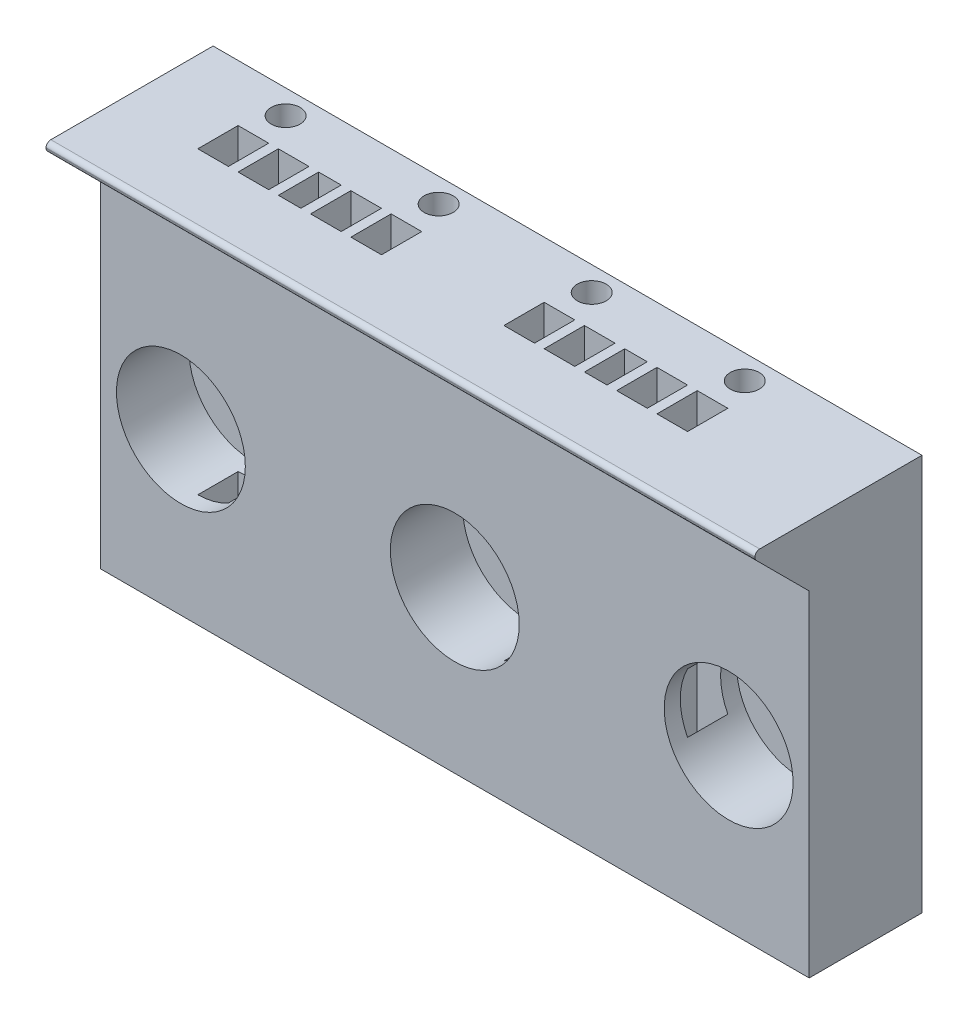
ISO-10303-21;
HEADER;
FILE_DESCRIPTION(('STEP AP214'),'2;1');
FILE_NAME('part.step','',(''),(''),'','','');
FILE_SCHEMA(('AUTOMOTIVE_DESIGN { 1 0 10303 214 1 1 1 1 }'));
ENDSEC;
DATA;
#1=APPLICATION_CONTEXT('core data for automotive mechanical design processes');
#2=APPLICATION_PROTOCOL_DEFINITION('international standard','automotive_design',2000,#1);
#3=PRODUCT_CONTEXT('',#1,'mechanical');
#4=PRODUCT('Part','Part','',(#3));
#5=PRODUCT_RELATED_PRODUCT_CATEGORY('part','',(#4));
#6=PRODUCT_DEFINITION_FORMATION('','',#4);
#7=PRODUCT_DEFINITION_CONTEXT('part definition',#1,'design');
#8=PRODUCT_DEFINITION('design','',#6,#7);
#9=PRODUCT_DEFINITION_SHAPE('','',#8);
#10=(LENGTH_UNIT() NAMED_UNIT(*) SI_UNIT(.MILLI.,.METRE.));
#11=(NAMED_UNIT(*) PLANE_ANGLE_UNIT() SI_UNIT($,.RADIAN.));
#12=(NAMED_UNIT(*) SI_UNIT($,.STERADIAN.) SOLID_ANGLE_UNIT());
#13=UNCERTAINTY_MEASURE_WITH_UNIT(LENGTH_MEASURE(1.E-05),#10,'distance_accuracy_value','');
#14=(GEOMETRIC_REPRESENTATION_CONTEXT(3) GLOBAL_UNCERTAINTY_ASSIGNED_CONTEXT((#13)) GLOBAL_UNIT_ASSIGNED_CONTEXT((#10,
#11,#12)) REPRESENTATION_CONTEXT('',''));
#15=CARTESIAN_POINT('',(0.,0.,0.));
#16=DIRECTION('',(0.,0.,1.));
#17=DIRECTION('',(1.,0.,0.));
#18=AXIS2_PLACEMENT_3D('',#15,#16,#17);
#19=CARTESIAN_POINT('',(39.,10.,10.371));
#20=DIRECTION('',(0.,0.,-1.));
#21=DIRECTION('',(-1.,0.,0.));
#22=AXIS2_PLACEMENT_3D('',#19,#20,#21);
#23=CYLINDRICAL_SURFACE('',#22,2.25);
#24=CARTESIAN_POINT('',(39.,10.,0.));
#25=DIRECTION('',(0.,0.,1.));
#26=DIRECTION('',(1.,0.,0.));
#27=AXIS2_PLACEMENT_3D('',#24,#25,#26);
#28=CIRCLE('',#27,2.25);
#29=CARTESIAN_POINT('',(41.25,10.,0.));
#30=VERTEX_POINT('',#29);
#31=EDGE_CURVE('E816',#30,#30,#28,.T.);
#32=ORIENTED_EDGE('',*,*,#31,.F.);
#33=EDGE_LOOP('',(#32));
#34=FACE_BOUND('',#33,.T.);
#35=CARTESIAN_POINT('',(39.,10.,2.50000000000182));
#36=DIRECTION('',(0.,0.,1.));
#37=DIRECTION('',(1.,0.,0.));
#38=AXIS2_PLACEMENT_3D('',#35,#36,#37);
#39=CIRCLE('',#38,2.25);
#40=CARTESIAN_POINT('',(41.25,10.,2.50000000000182));
#41=VERTEX_POINT('',#40);
#42=EDGE_CURVE('E770',#41,#41,#39,.T.);
#43=ORIENTED_EDGE('',*,*,#42,.T.);
#44=EDGE_LOOP('',(#43));
#45=FACE_BOUND('',#44,.T.);
#46=ADVANCED_FACE('F33',(#34,#45),#23,.F.);
#47=CARTESIAN_POINT('',(22.,10.,10.371));
#48=DIRECTION('',(0.,0.,-1.));
#49=DIRECTION('',(-1.,0.,0.));
#50=AXIS2_PLACEMENT_3D('',#47,#48,#49);
#51=CYLINDRICAL_SURFACE('',#50,2.25);
#52=CARTESIAN_POINT('',(24.25,10.,1.99749371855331));
#53=CARTESIAN_POINT('',(24.2499982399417,10.0629763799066,1.99749835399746));
#54=CARTESIAN_POINT('',(24.2473408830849,10.1260148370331,1.99355042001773));
#55=CARTESIAN_POINT('',(24.2368652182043,10.2506755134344,1.97720643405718));
#56=CARTESIAN_POINT('',(24.2290416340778,10.3122962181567,1.96480174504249));
#57=CARTESIAN_POINT('',(24.2124662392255,10.4111912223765,1.93584148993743));
#58=CARTESIAN_POINT('',(24.2049665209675,10.4495287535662,1.92219575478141));
#59=CARTESIAN_POINT('',(24.1885502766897,10.5236157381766,1.8897227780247));
#60=CARTESIAN_POINT('',(24.1796368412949,10.5593705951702,1.87090677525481));
#61=CARTESIAN_POINT('',(24.1639522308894,10.6167825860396,1.83361757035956));
#62=CARTESIAN_POINT('',(24.1573279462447,10.6394798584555,1.81669161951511));
#63=CARTESIAN_POINT('',(24.1442629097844,10.6820026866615,1.77946807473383));
#64=CARTESIAN_POINT('',(24.1378218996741,10.7018324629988,1.75917553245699));
#65=CARTESIAN_POINT('',(24.1272393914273,10.7331837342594,1.72042714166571));
#66=CARTESIAN_POINT('',(24.1229183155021,10.745555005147,1.70271222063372));
#67=CARTESIAN_POINT('',(24.1151217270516,10.7673946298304,1.66538709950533));
#68=CARTESIAN_POINT('',(24.1116457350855,10.7768646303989,1.64577798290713));
#69=CARTESIAN_POINT('',(24.1058850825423,10.7923497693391,1.60482854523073));
#70=CARTESIAN_POINT('',(24.1036122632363,10.7983306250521,1.58347332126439));
#71=CARTESIAN_POINT('',(24.1006217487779,10.8061681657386,1.53991436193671));
#72=CARTESIAN_POINT('',(24.0999024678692,10.8080290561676,1.5177115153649));
#73=CARTESIAN_POINT('',(24.1001033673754,10.8075053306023,1.47668976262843));
#74=CARTESIAN_POINT('',(24.1007953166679,10.8057117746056,1.45785939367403));
#75=CARTESIAN_POINT('',(24.1032988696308,10.7991533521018,1.42080508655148));
#76=CARTESIAN_POINT('',(24.105110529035,10.7943883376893,1.40258117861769));
#77=CARTESIAN_POINT('',(24.1096520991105,10.7822460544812,1.36735895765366));
#78=CARTESIAN_POINT('',(24.1123730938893,10.7748941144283,1.35035061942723));
#79=CARTESIAN_POINT('',(24.1185120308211,10.7579499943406,1.31763649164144));
#80=CARTESIAN_POINT('',(24.1219302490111,10.7483569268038,1.30193122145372));
#81=CARTESIAN_POINT('',(24.1311276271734,10.7218573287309,1.26418229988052));
#82=CARTESIAN_POINT('',(24.1372130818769,10.703735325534,1.24306511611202));
#83=CARTESIAN_POINT('',(24.1497795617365,10.6643633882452,1.20411863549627));
#84=CARTESIAN_POINT('',(24.1562615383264,10.6431057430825,1.18629769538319));
#85=CARTESIAN_POINT('',(24.1722229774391,10.5874807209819,1.14578658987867));
#86=CARTESIAN_POINT('',(24.1816295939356,10.5517598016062,1.12493396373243));
#87=CARTESIAN_POINT('',(24.1991281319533,10.477298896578,1.08890164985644));
#88=CARTESIAN_POINT('',(24.2072174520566,10.4385531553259,1.07373311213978));
#89=CARTESIAN_POINT('',(24.224876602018,10.3404797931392,1.0421145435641));
#90=CARTESIAN_POINT('',(24.2333461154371,10.2800615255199,1.02843248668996));
#91=CARTESIAN_POINT('',(24.2453353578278,10.1574454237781,1.0094916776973));
#92=CARTESIAN_POINT('',(24.2488473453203,10.0952449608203,1.00424609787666));
#93=CARTESIAN_POINT('',(24.2506954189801,9.96892406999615,1.00145610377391));
#94=CARTESIAN_POINT('',(24.2488899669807,9.90479694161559,1.00412229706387));
#95=CARTESIAN_POINT('',(24.2399074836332,9.77787435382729,1.01798873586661));
#96=CARTESIAN_POINT('',(24.2327388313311,9.71507697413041,1.02917566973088));
#97=CARTESIAN_POINT('',(24.2169213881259,9.61340078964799,1.05622400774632));
#98=CARTESIAN_POINT('',(24.2095749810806,9.57356258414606,1.06926006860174));
#99=CARTESIAN_POINT('',(24.1932604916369,9.4963622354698,1.10064026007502));
#100=CARTESIAN_POINT('',(24.1842948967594,9.45899641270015,1.11897627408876));
#101=CARTESIAN_POINT('',(24.1682929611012,9.39859922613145,1.15570844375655));
#102=CARTESIAN_POINT('',(24.1614554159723,9.37456294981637,1.17253114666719));
#103=CARTESIAN_POINT('',(24.1478620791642,9.32937272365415,1.20973697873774));
#104=CARTESIAN_POINT('',(24.1411061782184,9.30821441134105,1.23011460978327));
#105=CARTESIAN_POINT('',(24.1299825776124,9.27480809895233,1.26898544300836));
#106=CARTESIAN_POINT('',(24.125443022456,9.26165997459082,1.28665170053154));
#107=CARTESIAN_POINT('',(24.1171720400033,9.2382675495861,1.32399218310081));
#108=CARTESIAN_POINT('',(24.1134396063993,9.22801962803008,1.34366386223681));
#109=CARTESIAN_POINT('',(24.1076534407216,9.21237301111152,1.38156355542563));
#110=CARTESIAN_POINT('',(24.1054309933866,9.20647468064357,1.39955828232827));
#111=CARTESIAN_POINT('',(24.1020636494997,9.19759648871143,1.43635471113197));
#112=CARTESIAN_POINT('',(24.1009181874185,9.19461509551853,1.4551559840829));
#113=CARTESIAN_POINT('',(24.0998262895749,9.19177223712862,1.49307950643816));
#114=CARTESIAN_POINT('',(24.0998829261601,9.19191876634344,1.51220245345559));
#115=CARTESIAN_POINT('',(24.1011964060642,9.19534056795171,1.55012275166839));
#116=CARTESIAN_POINT('',(24.1024534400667,9.19861633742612,1.56892005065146));
#117=CARTESIAN_POINT('',(24.105967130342,9.20789805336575,1.60498665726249));
#118=CARTESIAN_POINT('',(24.1081860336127,9.21380109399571,1.622286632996));
#119=CARTESIAN_POINT('',(24.1134171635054,9.22797349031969,1.65575079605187));
#120=CARTESIAN_POINT('',(24.1164296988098,9.23624376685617,1.67191453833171));
#121=CARTESIAN_POINT('',(24.1244535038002,9.25878895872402,1.70960202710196));
#122=CARTESIAN_POINT('',(24.1297665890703,9.27411552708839,1.73043295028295));
#123=CARTESIAN_POINT('',(24.1409736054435,9.30786536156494,1.76922746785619));
#124=CARTESIAN_POINT('',(24.146868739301,9.32629509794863,1.78718491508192));
#125=CARTESIAN_POINT('',(24.1614752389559,9.37437638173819,1.82793032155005));
#126=CARTESIAN_POINT('',(24.1702432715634,9.40530910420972,1.84917922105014));
#127=CARTESIAN_POINT('',(24.1870148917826,9.47027933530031,1.88661915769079));
#128=CARTESIAN_POINT('',(24.195016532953,9.50432434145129,1.90279754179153));
#129=CARTESIAN_POINT('',(24.2133876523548,9.59218688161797,1.93797208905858));
#130=CARTESIAN_POINT('',(24.2228990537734,9.6472733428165,1.95423407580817));
#131=CARTESIAN_POINT('',(24.2378395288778,9.75958984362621,1.97886522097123));
#132=CARTESIAN_POINT('',(24.2432711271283,9.8168185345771,1.98723926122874));
#133=CARTESIAN_POINT('',(24.2476592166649,9.89527606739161,1.99394908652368));
#134=CARTESIAN_POINT('',(24.2485360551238,9.9161886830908,1.99528085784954));
#135=CARTESIAN_POINT('',(24.2497067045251,9.95806524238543,1.99705234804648));
#136=CARTESIAN_POINT('',(24.2500005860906,9.97902917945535,1.99749217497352));
#137=CARTESIAN_POINT('',(24.25,10.,1.99749371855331));
#138=B_SPLINE_CURVE_WITH_KNOTS('',3,(#52,#53,#54,#55,#56,#57,#58,#59,#60,#61,#62,#63,#64,#65,
#66,#67,#68,#69,#70,#71,#72,#73,#74,#75,#76,#77,#78,#79,#80,#81,#82,#83,#84,#85,#86,#87,#88,#89,
#90,#91,#92,#93,#94,#95,#96,#97,#98,#99,#100,#101,#102,#103,#104,#105,#106,#107,#108,#109,#110,
#111,#112,#113,#114,#115,#116,#117,#118,#119,#120,#121,#122,#123,#124,#125,#126,#127,#128,#129,
#130,#131,#132,#133,#134,#135,#136,#137),.UNSPECIFIED.,.T.,.F.,(4,2,2,2,2,2,2,2,2,2,2,2,2,2,2,2,
2,2,2,2,2,2,2,2,2,2,2,2,2,2,2,2,2,2,2,2,2,2,2,2,2,2,4),(0.,0.188867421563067,0.377928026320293,
0.501743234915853,0.625291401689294,0.712267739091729,0.799114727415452,0.864977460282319,
0.930802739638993,0.997264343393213,1.06365807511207,1.12016286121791,1.17667046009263,
1.23263951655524,1.28863077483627,1.37360095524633,1.45878368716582,1.58532927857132,
1.71212182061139,1.89869749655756,2.08556420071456,2.27744943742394,2.46903551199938,
2.59637821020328,2.72352691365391,2.8136369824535,2.90360890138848,2.97082483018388,
3.03795646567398,3.09491033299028,3.15183427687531,3.20890372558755,3.26598224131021,
3.32099873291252,3.37603665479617,3.4547984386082,3.53372652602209,3.64869890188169,
3.76395593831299,3.93768350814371,4.11130348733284,4.1742030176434,4.2370949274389),.UNSPECIFIED.);
#139=CARTESIAN_POINT('',(24.25,10.,1.99749371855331));
#140=VERTEX_POINT('',#139);
#141=EDGE_CURVE('E956',#140,#140,#138,.T.);
#142=ORIENTED_EDGE('',*,*,#141,.F.);
#143=EDGE_LOOP('',(#142));
#144=FACE_BOUND('',#143,.T.);
#145=CARTESIAN_POINT('',(22.,10.,0.));
#146=DIRECTION('',(0.,0.,1.));
#147=DIRECTION('',(1.,0.,0.));
#148=AXIS2_PLACEMENT_3D('',#145,#146,#147);
#149=CIRCLE('',#148,2.25);
#150=CARTESIAN_POINT('',(24.25,10.,0.));
#151=VERTEX_POINT('',#150);
#152=EDGE_CURVE('E819',#151,#151,#149,.T.);
#153=ORIENTED_EDGE('',*,*,#152,.F.);
#154=EDGE_LOOP('',(#153));
#155=FACE_BOUND('',#154,.T.);
#156=CARTESIAN_POINT('',(22.,10.,2.50000000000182));
#157=DIRECTION('',(0.,0.,1.));
#158=DIRECTION('',(1.,0.,0.));
#159=AXIS2_PLACEMENT_3D('',#156,#157,#158);
#160=CIRCLE('',#159,2.25);
#161=CARTESIAN_POINT('',(24.25,10.,2.50000000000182));
#162=VERTEX_POINT('',#161);
#163=EDGE_CURVE('E776',#162,#162,#160,.T.);
#164=ORIENTED_EDGE('',*,*,#163,.T.);
#165=EDGE_LOOP('',(#164));
#166=FACE_BOUND('',#165,.T.);
#167=ADVANCED_FACE('F938',(#144,#155,#166),#51,.F.);
#168=CARTESIAN_POINT('',(5.,10.,10.371));
#169=DIRECTION('',(0.,0.,-1.));
#170=DIRECTION('',(-1.,0.,0.));
#171=AXIS2_PLACEMENT_3D('',#168,#169,#170);
#172=CYLINDRICAL_SURFACE('',#171,2.25);
#173=CARTESIAN_POINT('',(6.,7.98443556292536,2.4));
#174=CARTESIAN_POINT('',(6.05742192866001,8.01292899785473,2.39999798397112));
#175=CARTESIAN_POINT('',(6.11363982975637,8.04390810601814,2.39448846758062));
#176=CARTESIAN_POINT('',(6.22195496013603,8.10966536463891,2.37395044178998));
#177=CARTESIAN_POINT('',(6.2740455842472,8.1444494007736,2.3589070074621));
#178=CARTESIAN_POINT('',(6.37277542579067,8.21627335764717,2.32086166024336));
#179=CARTESIAN_POINT('',(6.41945639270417,8.25329210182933,2.29792700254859));
#180=CARTESIAN_POINT('',(6.50750988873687,8.32868677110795,2.24503557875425));
#181=CARTESIAN_POINT('',(6.54887383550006,8.36706476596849,2.21506767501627));
#182=CARTESIAN_POINT('',(6.63346237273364,8.45129459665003,2.14220184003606));
#183=CARTESIAN_POINT('',(6.67551165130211,8.49716264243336,2.09792530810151));
#184=CARTESIAN_POINT('',(6.73202377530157,8.56352979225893,2.02448838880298));
#185=CARTESIAN_POINT('',(6.74975614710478,8.58523024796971,1.99886196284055));
#186=CARTESIAN_POINT('',(6.78288084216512,8.6272124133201,1.94507863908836));
#187=CARTESIAN_POINT('',(6.79827584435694,8.64749573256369,1.91692469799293));
#188=CARTESIAN_POINT('',(6.82538934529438,8.68434879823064,1.860067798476));
#189=CARTESIAN_POINT('',(6.83729669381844,8.70108282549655,1.83156336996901));
#190=CARTESIAN_POINT('',(6.85846825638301,8.73156027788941,1.77207662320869));
#191=CARTESIAN_POINT('',(6.86773641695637,8.7453081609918,1.74109809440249));
#192=CARTESIAN_POINT('',(6.88192265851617,8.76670859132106,1.68165328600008));
#193=CARTESIAN_POINT('',(6.88728734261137,8.77496940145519,1.6535187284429));
#194=CARTESIAN_POINT('',(6.89533449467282,8.78745556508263,1.59599959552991));
#195=CARTESIAN_POINT('',(6.898020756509,8.79168662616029,1.56661684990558));
#196=CARTESIAN_POINT('',(6.90046246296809,8.79552966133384,1.50726222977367));
#197=CARTESIAN_POINT('',(6.90020280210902,8.79511782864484,1.4772881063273));
#198=CARTESIAN_POINT('',(6.89674488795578,8.78968275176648,1.4179311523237));
#199=CARTESIAN_POINT('',(6.89354391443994,8.78465523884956,1.38854889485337));
#200=CARTESIAN_POINT('',(6.88359028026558,8.76927460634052,1.32539370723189));
#201=CARTESIAN_POINT('',(6.87625122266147,8.75805148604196,1.29193134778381));
#202=CARTESIAN_POINT('',(6.85842701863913,8.73153451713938,1.22755702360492));
#203=CARTESIAN_POINT('',(6.84793424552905,8.71623081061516,1.19665147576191));
#204=CARTESIAN_POINT('',(6.81724882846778,8.67291221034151,1.11958102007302));
#205=CARTESIAN_POINT('',(6.79501930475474,8.64279095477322,1.07542892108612));
#206=CARTESIAN_POINT('',(6.7451518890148,8.57922632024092,0.992974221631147));
#207=CARTESIAN_POINT('',(6.71749964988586,8.54577424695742,0.954687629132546));
#208=CARTESIAN_POINT('',(6.64657570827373,8.46537067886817,0.870758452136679));
#209=CARTESIAN_POINT('',(6.60125175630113,8.4178624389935,0.827367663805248));
#210=CARTESIAN_POINT('',(6.50225386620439,8.32357149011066,0.750565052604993));
#211=CARTESIAN_POINT('',(6.44858641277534,8.27678824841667,0.717145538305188));
#212=CARTESIAN_POINT('',(6.34361566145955,8.19422128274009,0.666517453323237));
#213=CARTESIAN_POINT('',(6.29357398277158,8.1579558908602,0.647486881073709));
#214=CARTESIAN_POINT('',(6.18884737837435,8.08870103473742,0.61836501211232));
#215=CARTESIAN_POINT('',(6.13416948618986,8.05570676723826,0.60826043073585));
#216=CARTESIAN_POINT('',(6.03074370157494,7.99926331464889,0.599285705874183));
#217=CARTESIAN_POINT('',(5.98250483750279,7.97513733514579,0.598837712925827));
#218=CARTESIAN_POINT('',(5.8848960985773,7.93062112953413,0.606052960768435));
#219=CARTESIAN_POINT('',(5.8355267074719,7.91022933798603,0.61371279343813));
#220=CARTESIAN_POINT('',(5.73708301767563,7.87350469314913,0.6377628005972));
#221=CARTESIAN_POINT('',(5.68801139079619,7.85719243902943,0.654196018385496));
#222=CARTESIAN_POINT('',(5.5924406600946,7.82882534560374,0.695879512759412));
#223=CARTESIAN_POINT('',(5.54594091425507,7.81676943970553,0.721127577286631));
#224=CARTESIAN_POINT('',(5.4614595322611,7.79743998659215,0.777284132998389));
#225=CARTESIAN_POINT('',(5.42308834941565,7.78983857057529,0.807497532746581));
#226=CARTESIAN_POINT('',(5.3515295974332,7.77733309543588,0.874003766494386));
#227=CARTESIAN_POINT('',(5.31834170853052,7.77242886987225,0.910296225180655));
#228=CARTESIAN_POINT('',(5.25854948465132,7.76470248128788,0.987541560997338));
#229=CARTESIAN_POINT('',(5.23188198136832,7.76185976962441,1.02844361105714));
#230=CARTESIAN_POINT('',(5.18548547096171,7.75753709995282,1.11407506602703));
#231=CARTESIAN_POINT('',(5.16575707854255,7.75605726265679,1.15880480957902));
#232=CARTESIAN_POINT('',(5.13340563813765,7.75389797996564,1.25199750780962));
#233=CARTESIAN_POINT('',(5.12096558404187,7.75323871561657,1.30052451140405));
#234=CARTESIAN_POINT('',(5.10429534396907,7.75240287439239,1.39897386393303));
#235=CARTESIAN_POINT('',(5.10006575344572,7.75222633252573,1.44889631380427));
#236=CARTESIAN_POINT('',(5.09993504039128,7.75222034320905,1.54932236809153));
#237=CARTESIAN_POINT('',(5.10412916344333,7.75239486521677,1.5998261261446));
#238=CARTESIAN_POINT('',(5.12091893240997,7.7532360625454,1.69941581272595));
#239=CARTESIAN_POINT('',(5.13351500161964,7.75390276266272,1.74850166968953));
#240=CARTESIAN_POINT('',(5.16675190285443,7.75612621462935,1.84387270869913));
#241=CARTESIAN_POINT('',(5.18739585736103,7.75768331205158,1.89015679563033));
#242=CARTESIAN_POINT('',(5.23610966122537,7.76228955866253,1.97855785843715));
#243=CARTESIAN_POINT('',(5.26417895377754,7.76533859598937,2.02067514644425));
#244=CARTESIAN_POINT('',(5.32651231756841,7.77359830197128,2.09907893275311));
#245=CARTESIAN_POINT('',(5.36070779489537,7.77878578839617,2.13542234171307));
#246=CARTESIAN_POINT('',(5.4343150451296,7.79199998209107,2.20175006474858));
#247=CARTESIAN_POINT('',(5.47372564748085,7.8000260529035,2.23173580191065));
#248=CARTESIAN_POINT('',(5.5553119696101,7.81921114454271,2.283926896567));
#249=CARTESIAN_POINT('',(5.59739748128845,7.83028948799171,2.30630326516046));
#250=CARTESIAN_POINT('',(5.68364411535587,7.85590332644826,2.34387818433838));
#251=CARTESIAN_POINT('',(5.72780446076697,7.87043753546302,2.35907939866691));
#252=CARTESIAN_POINT('',(5.81030771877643,7.9005843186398,2.3806626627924));
#253=CARTESIAN_POINT('',(5.84857362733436,7.91574098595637,2.38799881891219));
#254=CARTESIAN_POINT('',(5.92472982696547,7.94839213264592,2.39766875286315));
#255=CARTESIAN_POINT('',(5.96262002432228,7.96588718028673,2.40000131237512));
#256=CARTESIAN_POINT('',(6.,7.98443556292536,2.4));
#257=B_SPLINE_CURVE_WITH_KNOTS('',3,(#173,#174,#175,#176,#177,#178,#179,#180,#181,#182,#183,
#184,#185,#186,#187,#188,#189,#190,#191,#192,#193,#194,#195,#196,#197,#198,#199,#200,#201,#202,
#203,#204,#205,#206,#207,#208,#209,#210,#211,#212,#213,#214,#215,#216,#217,#218,#219,#220,#221,
#222,#223,#224,#225,#226,#227,#228,#229,#230,#231,#232,#233,#234,#235,#236,#237,#238,#239,#240,
#241,#242,#243,#244,#245,#246,#247,#248,#249,#250,#251,#252,#253,#254,#255,#256),.UNSPECIFIED.,
.T.,.F.,(4,2,2,2,2,2,2,2,2,2,2,2,2,2,2,2,2,2,2,2,2,2,2,2,2,2,2,2,2,2,2,2,2,2,2,2,2,2,2,2,2,4),
(0.,0.19213138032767,0.384564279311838,0.575396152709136,0.766532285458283,0.994471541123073,
1.10826237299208,1.22192178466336,1.3270808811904,1.43208189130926,1.52115539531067,
1.6101025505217,1.69950599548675,1.78899220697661,1.89653754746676,2.004345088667,
2.17704613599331,2.35021042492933,2.5851796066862,2.81996707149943,3.01321512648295,
3.2061750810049,3.3673146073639,3.52838642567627,3.69025584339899,3.85208466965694,
3.99964929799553,4.14720481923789,4.29326853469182,4.43934518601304,4.58894766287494,
4.73856098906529,4.88987549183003,5.04119761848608,5.19257851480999,5.34394806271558,
5.49371810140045,5.64345458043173,5.78956065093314,5.93561243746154,6.06065383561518,
6.18572567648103),.UNSPECIFIED.);
#258=CARTESIAN_POINT('',(6.,7.98443556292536,2.4));
#259=VERTEX_POINT('',#258);
#260=EDGE_CURVE('E442',#259,#259,#257,.T.);
#261=ORIENTED_EDGE('',*,*,#260,.F.);
#262=EDGE_LOOP('',(#261));
#263=FACE_BOUND('',#262,.T.);
#264=CARTESIAN_POINT('',(6.,12.0155644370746,2.4));
#265=CARTESIAN_POINT('',(5.95394237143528,12.038416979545,2.40000026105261));
#266=CARTESIAN_POINT('',(5.9070927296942,12.0596786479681,2.39645779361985));
#267=CARTESIAN_POINT('',(5.81308798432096,12.0985635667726,2.38165951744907));
#268=CARTESIAN_POINT('',(5.76593303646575,12.1161885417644,2.37040737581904));
#269=CARTESIAN_POINT('',(5.67275906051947,12.1476319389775,2.33983630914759));
#270=CARTESIAN_POINT('',(5.62674476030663,12.1614363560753,2.32048834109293));
#271=CARTESIAN_POINT('',(5.53782862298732,12.1852599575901,2.27389629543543));
#272=CARTESIAN_POINT('',(5.49492671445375,12.1952792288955,2.24665239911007));
#273=CARTESIAN_POINT('',(5.41614064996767,12.2115292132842,2.18660717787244));
#274=CARTESIAN_POINT('',(5.3800028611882,12.2179350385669,2.15418460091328));
#275=CARTESIAN_POINT('',(5.31326730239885,12.2283416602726,2.08373992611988));
#276=CARTESIAN_POINT('',(5.28266962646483,12.2323424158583,2.04571773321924));
#277=CARTESIAN_POINT('',(5.22788671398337,12.2386006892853,1.96500360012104));
#278=CARTESIAN_POINT('',(5.20372234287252,12.2408525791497,1.92229708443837));
#279=CARTESIAN_POINT('',(5.16263594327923,12.2442094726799,1.83349041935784));
#280=CARTESIAN_POINT('',(5.14571459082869,12.2453143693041,1.78738995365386));
#281=CARTESIAN_POINT('',(5.11927829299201,12.2468765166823,1.69193416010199));
#282=CARTESIAN_POINT('',(5.1099461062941,12.2473179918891,1.64252788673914));
#283=CARTESIAN_POINT('',(5.09962499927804,12.2477993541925,1.54284841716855));
#284=CARTESIAN_POINT('',(5.09863660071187,12.2478392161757,1.49257516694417));
#285=CARTESIAN_POINT('',(5.10505866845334,12.2475482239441,1.39214480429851));
#286=CARTESIAN_POINT('',(5.11253942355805,12.2472142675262,1.3419921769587));
#287=CARTESIAN_POINT('',(5.13580088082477,12.2459279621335,1.24365494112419));
#288=CARTESIAN_POINT('',(5.15158196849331,12.2449755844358,1.19547042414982));
#289=CARTESIAN_POINT('',(5.19096367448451,12.241967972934,1.1025003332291));
#290=CARTESIAN_POINT('',(5.21455649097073,12.2399138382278,1.05771142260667));
#291=CARTESIAN_POINT('',(5.26884277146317,12.2340469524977,0.972792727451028));
#292=CARTESIAN_POINT('',(5.29953538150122,12.2302344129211,0.932662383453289));
#293=CARTESIAN_POINT('',(5.3665352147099,12.2201981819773,0.858771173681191));
#294=CARTESIAN_POINT('',(5.40275801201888,12.2140089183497,0.824929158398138));
#295=CARTESIAN_POINT('',(5.4798469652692,12.1985876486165,0.763891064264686));
#296=CARTESIAN_POINT('',(5.52071184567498,12.1893564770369,0.736693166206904));
#297=CARTESIAN_POINT('',(5.60457615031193,12.1676755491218,0.690131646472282));
#298=CARTESIAN_POINT('',(5.64750278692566,12.1553065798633,0.67059884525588));
#299=CARTESIAN_POINT('',(5.7348416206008,12.1271137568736,0.63869078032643));
#300=CARTESIAN_POINT('',(5.77925385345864,12.1112898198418,0.626315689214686));
#301=CARTESIAN_POINT('',(5.8689863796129,12.0759891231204,0.60838947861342));
#302=CARTESIAN_POINT('',(5.91430798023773,12.0564490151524,0.602971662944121));
#303=CARTESIAN_POINT('',(6.003796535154,12.0142849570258,0.598892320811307));
#304=CARTESIAN_POINT('',(6.04796290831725,11.9916594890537,0.600234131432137));
#305=CARTESIAN_POINT('',(6.13893939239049,11.9412131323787,0.609489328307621));
#306=CARTESIAN_POINT('',(6.18551121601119,11.9130946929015,0.618104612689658));
#307=CARTESIAN_POINT('',(6.27529569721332,11.8544548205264,0.641879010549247));
#308=CARTESIAN_POINT('',(6.31850828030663,11.8239333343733,0.657038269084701));
#309=CARTESIAN_POINT('',(6.4088565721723,11.755392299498,0.69644687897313));
#310=CARTESIAN_POINT('',(6.45522696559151,11.7170340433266,0.721862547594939));
#311=CARTESIAN_POINT('',(6.54239774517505,11.6391909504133,0.779890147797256));
#312=CARTESIAN_POINT('',(6.58317935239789,11.5997028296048,0.812525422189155));
#313=CARTESIAN_POINT('',(6.66582624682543,11.5138246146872,0.89129462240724));
#314=CARTESIAN_POINT('',(6.70649431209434,11.4675102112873,0.938809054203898));
#315=CARTESIAN_POINT('',(6.76041930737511,11.4015136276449,1.01754432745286));
#316=CARTESIAN_POINT('',(6.77719333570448,11.3801257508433,1.04498295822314));
#317=CARTESIAN_POINT('',(6.80816742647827,11.3392837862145,1.1025903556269));
#318=CARTESIAN_POINT('',(6.82237168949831,11.3198265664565,1.13275454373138));
#319=CARTESIAN_POINT('',(6.84583327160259,11.2867580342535,1.19113853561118));
#320=CARTESIAN_POINT('',(6.85551617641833,11.2727080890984,1.21893411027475));
#321=CARTESIAN_POINT('',(6.87236131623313,11.2477937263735,1.27664604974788));
#322=CARTESIAN_POINT('',(6.87952655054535,11.2369255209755,1.30655983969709));
#323=CARTESIAN_POINT('',(6.89092700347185,11.2194295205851,1.36864129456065));
#324=CARTESIAN_POINT('',(6.8951219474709,11.212860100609,1.40083366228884));
#325=CARTESIAN_POINT('',(6.89995435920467,11.2052788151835,1.46612097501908));
#326=CARTESIAN_POINT('',(6.9005972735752,11.2042584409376,1.49921445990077));
#327=CARTESIAN_POINT('',(6.89841948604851,11.2076853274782,1.56043129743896));
#328=CARTESIAN_POINT('',(6.89605929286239,11.211405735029,1.58861683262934));
#329=CARTESIAN_POINT('',(6.8888589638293,11.2226020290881,1.64390589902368));
#330=CARTESIAN_POINT('',(6.88401592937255,11.2300823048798,1.67100812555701));
#331=CARTESIAN_POINT('',(6.86955089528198,11.2520047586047,1.73537552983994));
#332=CARTESIAN_POINT('',(6.85876206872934,11.2680631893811,1.77181880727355));
#333=CARTESIAN_POINT('',(6.83359159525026,11.3041973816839,1.8413199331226));
#334=CARTESIAN_POINT('',(6.81919907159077,11.3242852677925,1.87436709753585));
#335=CARTESIAN_POINT('',(6.77744294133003,11.3802351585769,1.95703489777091));
#336=CARTESIAN_POINT('',(6.74760616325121,11.4180874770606,2.00404757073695));
#337=CARTESIAN_POINT('',(6.68122642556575,11.4962061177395,2.0906840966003));
#338=CARTESIAN_POINT('',(6.64467329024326,11.5364760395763,2.13029655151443));
#339=CARTESIAN_POINT('',(6.56329095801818,11.6193080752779,2.20418061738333));
#340=CARTESIAN_POINT('',(6.51813734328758,11.6618833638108,2.23808211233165));
#341=CARTESIAN_POINT('',(6.42127209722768,11.7454428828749,2.29733637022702));
#342=CARTESIAN_POINT('',(6.36956753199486,11.7864287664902,2.3226982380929));
#343=CARTESIAN_POINT('',(6.2664630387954,11.860680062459,2.36119933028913));
#344=CARTESIAN_POINT('',(6.21571684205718,11.8942905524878,2.37541147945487));
#345=CARTESIAN_POINT('',(6.11036432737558,11.9578966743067,2.39480633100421));
#346=CARTESIAN_POINT('',(6.05576264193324,11.9878965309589,2.3999996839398));
#347=CARTESIAN_POINT('',(6.,12.0155644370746,2.4));
#348=B_SPLINE_CURVE_WITH_KNOTS('',3,(#264,#265,#266,#267,#268,#269,#270,#271,#272,#273,#274,
#275,#276,#277,#278,#279,#280,#281,#282,#283,#284,#285,#286,#287,#288,#289,#290,#291,#292,#293,
#294,#295,#296,#297,#298,#299,#300,#301,#302,#303,#304,#305,#306,#307,#308,#309,#310,#311,#312,
#313,#314,#315,#316,#317,#318,#319,#320,#321,#322,#323,#324,#325,#326,#327,#328,#329,#330,#331,
#332,#333,#334,#335,#336,#337,#338,#339,#340,#341,#342,#343,#344,#345,#346,#347),.UNSPECIFIED.,
.T.,.F.,(4,2,2,2,2,2,2,2,2,2,2,2,2,2,2,2,2,2,2,2,2,2,2,2,2,2,2,2,2,2,2,2,2,2,2,2,2,2,2,2,2,4),
(0.,0.154070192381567,0.308067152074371,0.462621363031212,0.617172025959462,0.763391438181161,
0.90961333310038,1.05630385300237,1.20300806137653,1.35314842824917,1.50329818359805,
1.65470328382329,1.80611541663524,1.95737678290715,2.10861996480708,2.25775028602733,
2.40683972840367,2.55242342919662,2.6980106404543,2.84634765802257,2.99475791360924,
3.15938125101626,3.32400823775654,3.51925630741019,3.71514513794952,3.94730069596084,
4.06300463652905,4.17851770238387,4.27611199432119,4.37358962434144,4.47236489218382,
4.57098865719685,4.65615915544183,4.74142931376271,4.86450677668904,4.98796028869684,
5.18885751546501,5.39006166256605,5.60141329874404,5.81253887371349,5.99929459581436,
6.18582962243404),.UNSPECIFIED.);
#349=CARTESIAN_POINT('',(6.,12.0155644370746,2.4));
#350=VERTEX_POINT('',#349);
#351=EDGE_CURVE('E984',#350,#350,#348,.T.);
#352=ORIENTED_EDGE('',*,*,#351,.F.);
#353=EDGE_LOOP('',(#352));
#354=FACE_BOUND('',#353,.T.);
#355=CARTESIAN_POINT('',(5.,10.,0.));
#356=DIRECTION('',(0.,0.,1.));
#357=DIRECTION('',(1.,0.,0.));
#358=AXIS2_PLACEMENT_3D('',#355,#356,#357);
#359=CIRCLE('',#358,2.25);
#360=CARTESIAN_POINT('',(7.25,10.,0.));
#361=VERTEX_POINT('',#360);
#362=EDGE_CURVE('E822',#361,#361,#359,.T.);
#363=ORIENTED_EDGE('',*,*,#362,.F.);
#364=EDGE_LOOP('',(#363));
#365=FACE_BOUND('',#364,.T.);
#366=CARTESIAN_POINT('',(5.,10.,2.50000000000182));
#367=DIRECTION('',(0.,0.,1.));
#368=DIRECTION('',(1.,0.,0.));
#369=AXIS2_PLACEMENT_3D('',#366,#367,#368);
#370=CIRCLE('',#369,2.25);
#371=CARTESIAN_POINT('',(7.25,10.,2.50000000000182));
#372=VERTEX_POINT('',#371);
#373=EDGE_CURVE('E783',#372,#372,#370,.T.);
#374=ORIENTED_EDGE('',*,*,#373,.T.);
#375=EDGE_LOOP('',(#374));
#376=FACE_BOUND('',#375,.T.);
#377=ADVANCED_FACE('F944',(#263,#354,#365,#376),#172,.F.);
#378=CARTESIAN_POINT('',(0.,24.5999999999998,10.371));
#379=DIRECTION('',(0.,0.,-1.));
#380=DIRECTION('',(-1.,0.,0.));
#381=AXIS2_PLACEMENT_3D('',#378,#379,#380);
#382=PLANE('',#381);
#383=DIRECTION('',(1.,0.,0.));
#384=VECTOR('',#383,1.);
#385=CARTESIAN_POINT('',(0.,24.3194331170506,10.371));
#386=LINE('',#385,#384);
#387=CARTESIAN_POINT('',(0.,24.3194331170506,10.371));
#388=VERTEX_POINT('',#387);
#389=CARTESIAN_POINT('',(44.,24.3194331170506,10.371));
#390=VERTEX_POINT('',#389);
#391=EDGE_CURVE('E814',#388,#390,#386,.T.);
#392=ORIENTED_EDGE('',*,*,#391,.F.);
#393=DIRECTION('',(0.,-1.,0.));
#394=VECTOR('',#393,1.);
#395=CARTESIAN_POINT('',(0.,0.,10.371));
#396=LINE('',#395,#394);
#397=CARTESIAN_POINT('',(0.,24.2805677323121,10.371));
#398=VERTEX_POINT('',#397);
#399=EDGE_CURVE('E826',#388,#398,#396,.T.);
#400=ORIENTED_EDGE('',*,*,#399,.T.);
#401=DIRECTION('',(1.,0.,0.));
#402=VECTOR('',#401,1.);
#403=CARTESIAN_POINT('',(0.,24.2805677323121,10.371));
#404=LINE('',#403,#402);
#405=CARTESIAN_POINT('',(44.,24.2805677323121,10.371));
#406=VERTEX_POINT('',#405);
#407=EDGE_CURVE('E808',#406,#398,#404,.F.);
#408=ORIENTED_EDGE('',*,*,#407,.F.);
#409=DIRECTION('',(0.,1.,0.));
#410=VECTOR('',#409,1.);
#411=CARTESIAN_POINT('',(44.,0.,10.371));
#412=LINE('',#411,#410);
#413=EDGE_CURVE('E829',#406,#390,#412,.T.);
#414=ORIENTED_EDGE('',*,*,#413,.T.);
#415=EDGE_LOOP('',(#392,#400,#408,#414));
#416=FACE_BOUND('',#415,.T.);
#417=ADVANCED_FACE('F1015',(#416),#382,.F.);
#418=CARTESIAN_POINT('',(0.,0.,10.371));
#419=DIRECTION('',(1.,0.,0.));
#420=DIRECTION('',(0.,0.,-1.));
#421=AXIS2_PLACEMENT_3D('',#418,#419,#420);
#422=PLANE('',#421);
#423=CARTESIAN_POINT('',(0.,24.3000004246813,10.0716300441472));
#424=DIRECTION('',(1.,0.,0.));
#425=DIRECTION('',(0.,0.,-1.));
#426=AXIS2_PLACEMENT_3D('',#423,#424,#425);
#427=CIRCLE('',#426,0.299999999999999);
#428=CARTESIAN_POINT('',(0.,24.6000004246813,10.0716300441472));
#429=VERTEX_POINT('',#428);
#430=EDGE_CURVE('E789',#429,#388,#427,.T.);
#431=ORIENTED_EDGE('',*,*,#430,.F.);
#432=DIRECTION('',(0.,0.,-1.));
#433=VECTOR('',#432,1.);
#434=CARTESIAN_POINT('',(0.,24.5999999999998,10.371));
#435=LINE('',#434,#433);
#436=CARTESIAN_POINT('',(0.,24.5999999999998,0.));
#437=VERTEX_POINT('',#436);
#438=EDGE_CURVE('E833',#429,#437,#435,.T.);
#439=ORIENTED_EDGE('',*,*,#438,.T.);
#440=DIRECTION('',(0.,-1.,0.));
#441=VECTOR('',#440,1.);
#442=CARTESIAN_POINT('',(0.,0.,0.));
#443=LINE('',#442,#441);
#444=CARTESIAN_POINT('',(0.,0.,0.));
#445=VERTEX_POINT('',#444);
#446=EDGE_CURVE('E825',#437,#445,#443,.T.);
#447=ORIENTED_EDGE('',*,*,#446,.T.);
#448=DIRECTION('',(0.,0.,-1.));
#449=VECTOR('',#448,1.);
#450=CARTESIAN_POINT('',(0.,0.,10.371));
#451=LINE('',#450,#449);
#452=CARTESIAN_POINT('',(0.,0.,7.00000000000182));
#453=VERTEX_POINT('',#452);
#454=EDGE_CURVE('E849',#453,#445,#451,.T.);
#455=ORIENTED_EDGE('',*,*,#454,.F.);
#456=DIRECTION('',(0.,-1.,0.));
#457=VECTOR('',#456,1.);
#458=CARTESIAN_POINT('',(0.,0.,7.00000000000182));
#459=LINE('',#458,#457);
#460=CARTESIAN_POINT('',(0.,20.8041063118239,7.00000000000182));
#461=VERTEX_POINT('',#460);
#462=EDGE_CURVE('E794',#461,#453,#459,.T.);
#463=ORIENTED_EDGE('',*,*,#462,.F.);
#464=DIRECTION('',(0.,-0.707106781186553,-0.707106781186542));
#465=VECTOR('',#464,1.);
#466=CARTESIAN_POINT('',(0.,24.0878683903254,10.2837620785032));
#467=LINE('',#466,#465);
#468=CARTESIAN_POINT('',(0.,24.0878683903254,10.2837620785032));
#469=VERTEX_POINT('',#468);
#470=EDGE_CURVE('E791',#469,#461,#467,.T.);
#471=ORIENTED_EDGE('',*,*,#470,.F.);
#472=EDGE_CURVE('E787',#398,#469,#427,.T.);
#473=ORIENTED_EDGE('',*,*,#472,.F.);
#474=ORIENTED_EDGE('',*,*,#399,.F.);
#475=EDGE_LOOP('',(#431,#439,#447,#455,#463,#471,#473,#474));
#476=FACE_BOUND('',#475,.T.);
#477=ADVANCED_FACE('F35',(#476),#422,.F.);
#478=CARTESIAN_POINT('',(0.,0.,10.371));
#479=DIRECTION('',(0.,1.,0.));
#480=DIRECTION('',(0.,0.,1.));
#481=AXIS2_PLACEMENT_3D('',#478,#479,#480);
#482=PLANE('',#481);
#483=CARTESIAN_POINT('',(34.5,0.,1.5));
#484=DIRECTION('',(0.,1.,0.));
#485=DIRECTION('',(0.,0.,1.));
#486=AXIS2_PLACEMENT_3D('',#483,#484,#485);
#487=CIRCLE('',#486,0.899999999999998);
#488=CARTESIAN_POINT('',(34.5,0.,2.4));
#489=VERTEX_POINT('',#488);
#490=EDGE_CURVE('E1701',#489,#489,#487,.T.);
#491=ORIENTED_EDGE('',*,*,#490,.T.);
#492=EDGE_LOOP('',(#491));
#493=FACE_BOUND('',#492,.T.);
#494=CARTESIAN_POINT('',(25.,0.,1.5));
#495=DIRECTION('',(0.,1.,0.));
#496=DIRECTION('',(0.,0.,1.));
#497=AXIS2_PLACEMENT_3D('',#494,#495,#496);
#498=CIRCLE('',#497,0.900000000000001);
#499=CARTESIAN_POINT('',(25.,0.,2.4));
#500=VERTEX_POINT('',#499);
#501=EDGE_CURVE('E964',#500,#500,#498,.T.);
#502=ORIENTED_EDGE('',*,*,#501,.T.);
#503=EDGE_LOOP('',(#502));
#504=FACE_BOUND('',#503,.T.);
#505=CARTESIAN_POINT('',(15.5,0.,1.5));
#506=DIRECTION('',(0.,1.,0.));
#507=DIRECTION('',(0.,0.,1.));
#508=AXIS2_PLACEMENT_3D('',#505,#506,#507);
#509=CIRCLE('',#508,0.900000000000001);
#510=CARTESIAN_POINT('',(15.5,0.,2.4));
#511=VERTEX_POINT('',#510);
#512=EDGE_CURVE('E967',#511,#511,#509,.T.);
#513=ORIENTED_EDGE('',*,*,#512,.T.);
#514=EDGE_LOOP('',(#513));
#515=FACE_BOUND('',#514,.T.);
#516=CARTESIAN_POINT('',(6.,0.,1.5));
#517=DIRECTION('',(0.,1.,0.));
#518=DIRECTION('',(0.,0.,1.));
#519=AXIS2_PLACEMENT_3D('',#516,#517,#518);
#520=CIRCLE('',#519,0.9);
#521=CARTESIAN_POINT('',(6.,0.,2.4));
#522=VERTEX_POINT('',#521);
#523=EDGE_CURVE('E989',#522,#522,#520,.T.);
#524=ORIENTED_EDGE('',*,*,#523,.T.);
#525=EDGE_LOOP('',(#524));
#526=FACE_BOUND('',#525,.T.);
#527=DIRECTION('',(0.,0.,-1.));
#528=VECTOR('',#527,1.);
#529=CARTESIAN_POINT('',(25.9500000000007,0.,3.5));
#530=LINE('',#529,#528);
#531=CARTESIAN_POINT('',(25.9500000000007,0.,6.));
#532=VERTEX_POINT('',#531);
#533=CARTESIAN_POINT('',(25.9500000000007,0.,3.5));
#534=VERTEX_POINT('',#533);
#535=EDGE_CURVE('E435',#532,#534,#530,.T.);
#536=ORIENTED_EDGE('',*,*,#535,.T.);
#537=DIRECTION('',(-1.,0.,0.));
#538=VECTOR('',#537,1.);
#539=CARTESIAN_POINT('',(24.0500000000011,0.,3.5));
#540=LINE('',#539,#538);
#541=CARTESIAN_POINT('',(24.0500000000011,0.,3.5));
#542=VERTEX_POINT('',#541);
#543=EDGE_CURVE('E419',#534,#542,#540,.T.);
#544=ORIENTED_EDGE('',*,*,#543,.T.);
#545=DIRECTION('',(0.,0.,1.));
#546=VECTOR('',#545,1.);
#547=CARTESIAN_POINT('',(24.0500000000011,0.,3.5));
#548=LINE('',#547,#546);
#549=CARTESIAN_POINT('',(24.0500000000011,0.,6.));
#550=VERTEX_POINT('',#549);
#551=EDGE_CURVE('E427',#542,#550,#548,.T.);
#552=ORIENTED_EDGE('',*,*,#551,.T.);
#553=DIRECTION('',(1.,0.,0.));
#554=VECTOR('',#553,1.);
#555=CARTESIAN_POINT('',(24.0500000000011,0.,6.));
#556=LINE('',#555,#554);
#557=EDGE_CURVE('E50',#550,#532,#556,.T.);
#558=ORIENTED_EDGE('',*,*,#557,.T.);
#559=EDGE_LOOP('',(#536,#544,#552,#558));
#560=FACE_BOUND('',#559,.T.);
#561=DIRECTION('',(-1.,0.,0.));
#562=VECTOR('',#561,1.);
#563=CARTESIAN_POINT('',(26.5500000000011,0.,3.5));
#564=LINE('',#563,#562);
#565=CARTESIAN_POINT('',(28.4500000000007,0.,3.5));
#566=VERTEX_POINT('',#565);
#567=CARTESIAN_POINT('',(26.5500000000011,0.,3.5));
#568=VERTEX_POINT('',#567);
#569=EDGE_CURVE('E476',#566,#568,#564,.T.);
#570=ORIENTED_EDGE('',*,*,#569,.T.);
#571=DIRECTION('',(0.,0.,1.));
#572=VECTOR('',#571,1.);
#573=CARTESIAN_POINT('',(26.5500000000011,0.,3.5));
#574=LINE('',#573,#572);
#575=CARTESIAN_POINT('',(26.5500000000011,0.,6.));
#576=VERTEX_POINT('',#575);
#577=EDGE_CURVE('E466',#568,#576,#574,.T.);
#578=ORIENTED_EDGE('',*,*,#577,.T.);
#579=DIRECTION('',(1.,0.,0.));
#580=VECTOR('',#579,1.);
#581=CARTESIAN_POINT('',(26.5500000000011,0.,6.));
#582=LINE('',#581,#580);
#583=CARTESIAN_POINT('',(28.4500000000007,0.,6.));
#584=VERTEX_POINT('',#583);
#585=EDGE_CURVE('E469',#576,#584,#582,.T.);
#586=ORIENTED_EDGE('',*,*,#585,.T.);
#587=DIRECTION('',(0.,0.,-1.));
#588=VECTOR('',#587,1.);
#589=CARTESIAN_POINT('',(28.4500000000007,0.,3.5));
#590=LINE('',#589,#588);
#591=EDGE_CURVE('E473',#584,#566,#590,.T.);
#592=ORIENTED_EDGE('',*,*,#591,.T.);
#593=EDGE_LOOP('',(#570,#578,#586,#592));
#594=FACE_BOUND('',#593,.T.);
#595=DIRECTION('',(-1.,0.,0.));
#596=VECTOR('',#595,1.);
#597=CARTESIAN_POINT('',(29.0500000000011,0.,3.5));
#598=LINE('',#597,#596);
#599=CARTESIAN_POINT('',(30.4500000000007,0.,3.5));
#600=VERTEX_POINT('',#599);
#601=CARTESIAN_POINT('',(29.0500000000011,0.,3.5));
#602=VERTEX_POINT('',#601);
#603=EDGE_CURVE('E508',#600,#602,#598,.T.);
#604=ORIENTED_EDGE('',*,*,#603,.T.);
#605=DIRECTION('',(0.,0.,1.));
#606=VECTOR('',#605,1.);
#607=CARTESIAN_POINT('',(29.0500000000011,0.,3.5));
#608=LINE('',#607,#606);
#609=CARTESIAN_POINT('',(29.0500000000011,0.,6.));
#610=VERTEX_POINT('',#609);
#611=EDGE_CURVE('E498',#602,#610,#608,.T.);
#612=ORIENTED_EDGE('',*,*,#611,.T.);
#613=DIRECTION('',(1.,0.,0.));
#614=VECTOR('',#613,1.);
#615=CARTESIAN_POINT('',(29.0500000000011,0.,6.));
#616=LINE('',#615,#614);
#617=CARTESIAN_POINT('',(30.4500000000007,0.,6.));
#618=VERTEX_POINT('',#617);
#619=EDGE_CURVE('E501',#610,#618,#616,.T.);
#620=ORIENTED_EDGE('',*,*,#619,.T.);
#621=DIRECTION('',(0.,0.,-1.));
#622=VECTOR('',#621,1.);
#623=CARTESIAN_POINT('',(30.4500000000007,0.,3.5));
#624=LINE('',#623,#622);
#625=EDGE_CURVE('E505',#618,#600,#624,.T.);
#626=ORIENTED_EDGE('',*,*,#625,.T.);
#627=EDGE_LOOP('',(#604,#612,#620,#626));
#628=FACE_BOUND('',#627,.T.);
#629=DIRECTION('',(-1.,0.,0.));
#630=VECTOR('',#629,1.);
#631=CARTESIAN_POINT('',(31.0500000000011,0.,3.5));
#632=LINE('',#631,#630);
#633=CARTESIAN_POINT('',(32.9500000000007,0.,3.5));
#634=VERTEX_POINT('',#633);
#635=CARTESIAN_POINT('',(31.0500000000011,0.,3.5));
#636=VERTEX_POINT('',#635);
#637=EDGE_CURVE('E540',#634,#636,#632,.T.);
#638=ORIENTED_EDGE('',*,*,#637,.T.);
#639=DIRECTION('',(0.,0.,1.));
#640=VECTOR('',#639,1.);
#641=CARTESIAN_POINT('',(31.0500000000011,0.,3.5));
#642=LINE('',#641,#640);
#643=CARTESIAN_POINT('',(31.0500000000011,0.,6.));
#644=VERTEX_POINT('',#643);
#645=EDGE_CURVE('E530',#636,#644,#642,.T.);
#646=ORIENTED_EDGE('',*,*,#645,.T.);
#647=DIRECTION('',(1.,0.,0.));
#648=VECTOR('',#647,1.);
#649=CARTESIAN_POINT('',(31.0500000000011,0.,6.));
#650=LINE('',#649,#648);
#651=CARTESIAN_POINT('',(32.9500000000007,0.,6.));
#652=VERTEX_POINT('',#651);
#653=EDGE_CURVE('E533',#644,#652,#650,.T.);
#654=ORIENTED_EDGE('',*,*,#653,.T.);
#655=DIRECTION('',(0.,0.,-1.));
#656=VECTOR('',#655,1.);
#657=CARTESIAN_POINT('',(32.9500000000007,0.,3.5));
#658=LINE('',#657,#656);
#659=EDGE_CURVE('E537',#652,#634,#658,.T.);
#660=ORIENTED_EDGE('',*,*,#659,.T.);
#661=EDGE_LOOP('',(#638,#646,#654,#660));
#662=FACE_BOUND('',#661,.T.);
#663=DIRECTION('',(-1.,0.,0.));
#664=VECTOR('',#663,1.);
#665=CARTESIAN_POINT('',(33.5500000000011,0.,3.5));
#666=LINE('',#665,#664);
#667=CARTESIAN_POINT('',(35.4500000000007,0.,3.5));
#668=VERTEX_POINT('',#667);
#669=CARTESIAN_POINT('',(33.5500000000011,0.,3.5));
#670=VERTEX_POINT('',#669);
#671=EDGE_CURVE('E572',#668,#670,#666,.T.);
#672=ORIENTED_EDGE('',*,*,#671,.T.);
#673=DIRECTION('',(0.,0.,1.));
#674=VECTOR('',#673,1.);
#675=CARTESIAN_POINT('',(33.5500000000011,0.,3.5));
#676=LINE('',#675,#674);
#677=CARTESIAN_POINT('',(33.5500000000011,0.,6.));
#678=VERTEX_POINT('',#677);
#679=EDGE_CURVE('E562',#670,#678,#676,.T.);
#680=ORIENTED_EDGE('',*,*,#679,.T.);
#681=DIRECTION('',(1.,0.,0.));
#682=VECTOR('',#681,1.);
#683=CARTESIAN_POINT('',(33.5500000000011,0.,6.));
#684=LINE('',#683,#682);
#685=CARTESIAN_POINT('',(35.4500000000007,0.,6.));
#686=VERTEX_POINT('',#685);
#687=EDGE_CURVE('E565',#678,#686,#684,.T.);
#688=ORIENTED_EDGE('',*,*,#687,.T.);
#689=DIRECTION('',(0.,0.,-1.));
#690=VECTOR('',#689,1.);
#691=CARTESIAN_POINT('',(35.4500000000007,0.,3.5));
#692=LINE('',#691,#690);
#693=EDGE_CURVE('E569',#686,#668,#692,.T.);
#694=ORIENTED_EDGE('',*,*,#693,.T.);
#695=EDGE_LOOP('',(#672,#680,#688,#694));
#696=FACE_BOUND('',#695,.T.);
#697=DIRECTION('',(0.,0.,-1.));
#698=VECTOR('',#697,1.);
#699=CARTESIAN_POINT('',(16.4500000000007,0.,3.5));
#700=LINE('',#699,#698);
#701=CARTESIAN_POINT('',(16.4500000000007,0.,6.));
#702=VERTEX_POINT('',#701);
#703=CARTESIAN_POINT('',(16.4500000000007,0.,3.5));
#704=VERTEX_POINT('',#703);
#705=EDGE_CURVE('E608',#702,#704,#700,.T.);
#706=ORIENTED_EDGE('',*,*,#705,.T.);
#707=DIRECTION('',(-1.,0.,0.));
#708=VECTOR('',#707,1.);
#709=CARTESIAN_POINT('',(14.5500000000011,0.,3.5));
#710=LINE('',#709,#708);
#711=CARTESIAN_POINT('',(14.5500000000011,0.,3.5));
#712=VERTEX_POINT('',#711);
#713=EDGE_CURVE('E598',#704,#712,#710,.T.);
#714=ORIENTED_EDGE('',*,*,#713,.T.);
#715=DIRECTION('',(0.,0.,1.));
#716=VECTOR('',#715,1.);
#717=CARTESIAN_POINT('',(14.5500000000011,0.,3.5));
#718=LINE('',#717,#716);
#719=CARTESIAN_POINT('',(14.5500000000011,0.,6.));
#720=VERTEX_POINT('',#719);
#721=EDGE_CURVE('E601',#712,#720,#718,.T.);
#722=ORIENTED_EDGE('',*,*,#721,.T.);
#723=DIRECTION('',(1.,0.,0.));
#724=VECTOR('',#723,1.);
#725=CARTESIAN_POINT('',(14.5500000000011,0.,6.));
#726=LINE('',#725,#724);
#727=EDGE_CURVE('E605',#720,#702,#726,.T.);
#728=ORIENTED_EDGE('',*,*,#727,.T.);
#729=EDGE_LOOP('',(#706,#714,#722,#728));
#730=FACE_BOUND('',#729,.T.);
#731=DIRECTION('',(0.,0.,-1.));
#732=VECTOR('',#731,1.);
#733=CARTESIAN_POINT('',(13.9500000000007,0.,3.5));
#734=LINE('',#733,#732);
#735=CARTESIAN_POINT('',(13.9500000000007,0.,6.));
#736=VERTEX_POINT('',#735);
#737=CARTESIAN_POINT('',(13.9500000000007,0.,3.5));
#738=VERTEX_POINT('',#737);
#739=EDGE_CURVE('E640',#736,#738,#734,.T.);
#740=ORIENTED_EDGE('',*,*,#739,.T.);
#741=DIRECTION('',(-1.,0.,0.));
#742=VECTOR('',#741,1.);
#743=CARTESIAN_POINT('',(12.0500000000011,0.,3.5));
#744=LINE('',#743,#742);
#745=CARTESIAN_POINT('',(12.0500000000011,0.,3.5));
#746=VERTEX_POINT('',#745);
#747=EDGE_CURVE('E630',#738,#746,#744,.T.);
#748=ORIENTED_EDGE('',*,*,#747,.T.);
#749=DIRECTION('',(0.,0.,1.));
#750=VECTOR('',#749,1.);
#751=CARTESIAN_POINT('',(12.0500000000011,0.,3.5));
#752=LINE('',#751,#750);
#753=CARTESIAN_POINT('',(12.0500000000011,0.,6.));
#754=VERTEX_POINT('',#753);
#755=EDGE_CURVE('E633',#746,#754,#752,.T.);
#756=ORIENTED_EDGE('',*,*,#755,.T.);
#757=DIRECTION('',(1.,0.,0.));
#758=VECTOR('',#757,1.);
#759=CARTESIAN_POINT('',(12.0500000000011,0.,6.));
#760=LINE('',#759,#758);
#761=EDGE_CURVE('E637',#754,#736,#760,.T.);
#762=ORIENTED_EDGE('',*,*,#761,.T.);
#763=EDGE_LOOP('',(#740,#748,#756,#762));
#764=FACE_BOUND('',#763,.T.);
#765=DIRECTION('',(0.,0.,-1.));
#766=VECTOR('',#765,1.);
#767=CARTESIAN_POINT('',(11.4500000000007,0.,3.5));
#768=LINE('',#767,#766);
#769=CARTESIAN_POINT('',(11.4500000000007,0.,6.));
#770=VERTEX_POINT('',#769);
#771=CARTESIAN_POINT('',(11.4500000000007,0.,3.5));
#772=VERTEX_POINT('',#771);
#773=EDGE_CURVE('E672',#770,#772,#768,.T.);
#774=ORIENTED_EDGE('',*,*,#773,.T.);
#775=DIRECTION('',(-1.,0.,0.));
#776=VECTOR('',#775,1.);
#777=CARTESIAN_POINT('',(10.0500000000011,0.,3.5));
#778=LINE('',#777,#776);
#779=CARTESIAN_POINT('',(10.0500000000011,0.,3.5));
#780=VERTEX_POINT('',#779);
#781=EDGE_CURVE('E662',#772,#780,#778,.T.);
#782=ORIENTED_EDGE('',*,*,#781,.T.);
#783=DIRECTION('',(0.,0.,1.));
#784=VECTOR('',#783,1.);
#785=CARTESIAN_POINT('',(10.0500000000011,0.,3.5));
#786=LINE('',#785,#784);
#787=CARTESIAN_POINT('',(10.0500000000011,0.,6.));
#788=VERTEX_POINT('',#787);
#789=EDGE_CURVE('E665',#780,#788,#786,.T.);
#790=ORIENTED_EDGE('',*,*,#789,.T.);
#791=DIRECTION('',(1.,0.,0.));
#792=VECTOR('',#791,1.);
#793=CARTESIAN_POINT('',(10.0500000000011,0.,6.));
#794=LINE('',#793,#792);
#795=EDGE_CURVE('E669',#788,#770,#794,.T.);
#796=ORIENTED_EDGE('',*,*,#795,.T.);
#797=EDGE_LOOP('',(#774,#782,#790,#796));
#798=FACE_BOUND('',#797,.T.);
#799=DIRECTION('',(0.,0.,-1.));
#800=VECTOR('',#799,1.);
#801=CARTESIAN_POINT('',(9.45000000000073,0.,3.5));
#802=LINE('',#801,#800);
#803=CARTESIAN_POINT('',(9.45000000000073,0.,6.));
#804=VERTEX_POINT('',#803);
#805=CARTESIAN_POINT('',(9.45000000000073,0.,3.5));
#806=VERTEX_POINT('',#805);
#807=EDGE_CURVE('E704',#804,#806,#802,.T.);
#808=ORIENTED_EDGE('',*,*,#807,.T.);
#809=DIRECTION('',(-1.,0.,0.));
#810=VECTOR('',#809,1.);
#811=CARTESIAN_POINT('',(7.55000000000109,0.,3.5));
#812=LINE('',#811,#810);
#813=CARTESIAN_POINT('',(7.55000000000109,0.,3.5));
#814=VERTEX_POINT('',#813);
#815=EDGE_CURVE('E694',#806,#814,#812,.T.);
#816=ORIENTED_EDGE('',*,*,#815,.T.);
#817=DIRECTION('',(0.,0.,1.));
#818=VECTOR('',#817,1.);
#819=CARTESIAN_POINT('',(7.55000000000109,0.,3.5));
#820=LINE('',#819,#818);
#821=CARTESIAN_POINT('',(7.55000000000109,0.,6.));
#822=VERTEX_POINT('',#821);
#823=EDGE_CURVE('E697',#814,#822,#820,.T.);
#824=ORIENTED_EDGE('',*,*,#823,.T.);
#825=DIRECTION('',(1.,0.,0.));
#826=VECTOR('',#825,1.);
#827=CARTESIAN_POINT('',(7.55000000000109,0.,6.));
#828=LINE('',#827,#826);
#829=EDGE_CURVE('E701',#822,#804,#828,.T.);
#830=ORIENTED_EDGE('',*,*,#829,.T.);
#831=EDGE_LOOP('',(#808,#816,#824,#830));
#832=FACE_BOUND('',#831,.T.);
#833=DIRECTION('',(-1.,0.,0.));
#834=VECTOR('',#833,1.);
#835=CARTESIAN_POINT('',(5.05000000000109,0.,3.5));
#836=LINE('',#835,#834);
#837=CARTESIAN_POINT('',(6.95000000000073,0.,3.5));
#838=VERTEX_POINT('',#837);
#839=CARTESIAN_POINT('',(5.05000000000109,0.,3.5));
#840=VERTEX_POINT('',#839);
#841=EDGE_CURVE('E739',#838,#840,#836,.T.);
#842=ORIENTED_EDGE('',*,*,#841,.T.);
#843=DIRECTION('',(0.,0.,1.));
#844=VECTOR('',#843,1.);
#845=CARTESIAN_POINT('',(5.05000000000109,0.,3.5));
#846=LINE('',#845,#844);
#847=CARTESIAN_POINT('',(5.05000000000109,0.,6.));
#848=VERTEX_POINT('',#847);
#849=EDGE_CURVE('E729',#840,#848,#846,.T.);
#850=ORIENTED_EDGE('',*,*,#849,.T.);
#851=DIRECTION('',(1.,0.,0.));
#852=VECTOR('',#851,1.);
#853=CARTESIAN_POINT('',(5.05000000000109,0.,6.));
#854=LINE('',#853,#852);
#855=CARTESIAN_POINT('',(6.95000000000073,0.,6.));
#856=VERTEX_POINT('',#855);
#857=EDGE_CURVE('E732',#848,#856,#854,.T.);
#858=ORIENTED_EDGE('',*,*,#857,.T.);
#859=DIRECTION('',(0.,0.,-1.));
#860=VECTOR('',#859,1.);
#861=CARTESIAN_POINT('',(6.95000000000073,0.,3.5));
#862=LINE('',#861,#860);
#863=EDGE_CURVE('E736',#856,#838,#862,.T.);
#864=ORIENTED_EDGE('',*,*,#863,.T.);
#865=EDGE_LOOP('',(#842,#850,#858,#864));
#866=FACE_BOUND('',#865,.T.);
#867=DIRECTION('',(1.,0.,0.));
#868=VECTOR('',#867,1.);
#869=CARTESIAN_POINT('',(0.,0.,7.00000000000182));
#870=LINE('',#869,#868);
#871=CARTESIAN_POINT('',(44.,0.,7.00000000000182));
#872=VERTEX_POINT('',#871);
#873=EDGE_CURVE('E806',#453,#872,#870,.T.);
#874=ORIENTED_EDGE('',*,*,#873,.F.);
#875=ORIENTED_EDGE('',*,*,#454,.T.);
#876=DIRECTION('',(1.,0.,0.));
#877=VECTOR('',#876,1.);
#878=CARTESIAN_POINT('',(0.,0.,0.));
#879=LINE('',#878,#877);
#880=CARTESIAN_POINT('',(44.,0.,0.));
#881=VERTEX_POINT('',#880);
#882=EDGE_CURVE('E836',#445,#881,#879,.T.);
#883=ORIENTED_EDGE('',*,*,#882,.T.);
#884=DIRECTION('',(0.,0.,-1.));
#885=VECTOR('',#884,1.);
#886=CARTESIAN_POINT('',(44.,0.,10.371));
#887=LINE('',#886,#885);
#888=EDGE_CURVE('E847',#872,#881,#887,.T.);
#889=ORIENTED_EDGE('',*,*,#888,.F.);
#890=EDGE_LOOP('',(#874,#875,#883,#889));
#891=FACE_BOUND('',#890,.T.);
#892=ADVANCED_FACE('F432',(#493,#504,#515,#526,#560,#594,#628,#662,#696,#730,#764,#798,#832,
#866,#891),#482,.F.);
#893=CARTESIAN_POINT('',(44.,0.,10.371));
#894=DIRECTION('',(-1.,0.,0.));
#895=DIRECTION('',(0.,0.,1.));
#896=AXIS2_PLACEMENT_3D('',#893,#894,#895);
#897=PLANE('',#896);
#898=CARTESIAN_POINT('',(44.,24.3000004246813,10.0716300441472));
#899=DIRECTION('',(1.,0.,0.));
#900=DIRECTION('',(0.,0.,-1.));
#901=AXIS2_PLACEMENT_3D('',#898,#899,#900);
#902=CIRCLE('',#901,0.299999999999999);
#903=CARTESIAN_POINT('',(44.,24.5999999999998,10.0716300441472));
#904=VERTEX_POINT('',#903);
#905=EDGE_CURVE('E800',#904,#390,#902,.T.);
#906=ORIENTED_EDGE('',*,*,#905,.T.);
#907=ORIENTED_EDGE('',*,*,#413,.F.);
#908=CARTESIAN_POINT('',(44.,24.0878683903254,10.2837620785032));
#909=VERTEX_POINT('',#908);
#910=EDGE_CURVE('E797',#406,#909,#902,.T.);
#911=ORIENTED_EDGE('',*,*,#910,.T.);
#912=DIRECTION('',(0.,-0.707106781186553,-0.707106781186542));
#913=VECTOR('',#912,1.);
#914=CARTESIAN_POINT('',(44.,24.0878683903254,10.2837620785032));
#915=LINE('',#914,#913);
#916=CARTESIAN_POINT('',(44.,20.8041063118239,7.00000000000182));
#917=VERTEX_POINT('',#916);
#918=EDGE_CURVE('E801',#909,#917,#915,.T.);
#919=ORIENTED_EDGE('',*,*,#918,.T.);
#920=DIRECTION('',(0.,-1.,0.));
#921=VECTOR('',#920,1.);
#922=CARTESIAN_POINT('',(44.,0.,7.00000000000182));
#923=LINE('',#922,#921);
#924=EDGE_CURVE('E790',#917,#872,#923,.T.);
#925=ORIENTED_EDGE('',*,*,#924,.T.);
#926=ORIENTED_EDGE('',*,*,#888,.T.);
#927=DIRECTION('',(0.,1.,0.));
#928=VECTOR('',#927,1.);
#929=CARTESIAN_POINT('',(44.,0.,0.));
#930=LINE('',#929,#928);
#931=CARTESIAN_POINT('',(44.,24.5999999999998,0.));
#932=VERTEX_POINT('',#931);
#933=EDGE_CURVE('E839',#881,#932,#930,.T.);
#934=ORIENTED_EDGE('',*,*,#933,.T.);
#935=DIRECTION('',(0.,0.,-1.));
#936=VECTOR('',#935,1.);
#937=CARTESIAN_POINT('',(44.,24.5999999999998,10.371));
#938=LINE('',#937,#936);
#939=EDGE_CURVE('E845',#904,#932,#938,.T.);
#940=ORIENTED_EDGE('',*,*,#939,.F.);
#941=EDGE_LOOP('',(#906,#907,#911,#919,#925,#926,#934,#940));
#942=FACE_BOUND('',#941,.T.);
#943=ADVANCED_FACE('F1002',(#942),#897,.F.);
#944=CARTESIAN_POINT('',(0.,24.5999999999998,0.));
#945=DIRECTION('',(0.,0.,-1.));
#946=DIRECTION('',(-1.,0.,0.));
#947=AXIS2_PLACEMENT_3D('',#944,#945,#946);
#948=PLANE('',#947);
#949=ORIENTED_EDGE('',*,*,#152,.T.);
#950=EDGE_LOOP('',(#949));
#951=FACE_BOUND('',#950,.T.);
#952=ORIENTED_EDGE('',*,*,#446,.F.);
#953=DIRECTION('',(-1.,0.,0.));
#954=VECTOR('',#953,1.);
#955=CARTESIAN_POINT('',(0.,24.5999999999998,0.));
#956=LINE('',#955,#954);
#957=EDGE_CURVE('E830',#932,#437,#956,.T.);
#958=ORIENTED_EDGE('',*,*,#957,.F.);
#959=ORIENTED_EDGE('',*,*,#933,.F.);
#960=ORIENTED_EDGE('',*,*,#882,.F.);
#961=EDGE_LOOP('',(#952,#958,#959,#960));
#962=FACE_BOUND('',#961,.T.);
#963=ORIENTED_EDGE('',*,*,#362,.T.);
#964=EDGE_LOOP('',(#963));
#965=FACE_BOUND('',#964,.T.);
#966=ORIENTED_EDGE('',*,*,#31,.T.);
#967=EDGE_LOOP('',(#966));
#968=FACE_BOUND('',#967,.T.);
#969=ADVANCED_FACE('F1071',(#951,#962,#965,#968),#948,.T.);
#970=CARTESIAN_POINT('',(0.,24.5999999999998,10.371));
#971=DIRECTION('',(0.,-1.,0.));
#972=DIRECTION('',(0.,0.,-1.));
#973=AXIS2_PLACEMENT_3D('',#970,#971,#972);
#974=PLANE('',#973);
#975=CARTESIAN_POINT('',(34.5,24.5999999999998,1.5));
#976=DIRECTION('',(0.,1.,0.));
#977=DIRECTION('',(0.,0.,1.));
#978=AXIS2_PLACEMENT_3D('',#975,#976,#977);
#979=CIRCLE('',#978,0.899999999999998);
#980=CARTESIAN_POINT('',(34.5,24.5999999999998,2.4));
#981=VERTEX_POINT('',#980);
#982=EDGE_CURVE('E1704',#981,#981,#979,.T.);
#983=ORIENTED_EDGE('',*,*,#982,.F.);
#984=EDGE_LOOP('',(#983));
#985=FACE_BOUND('',#984,.T.);
#986=CARTESIAN_POINT('',(25.,24.5999999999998,1.5));
#987=DIRECTION('',(0.,1.,0.));
#988=DIRECTION('',(0.,0.,1.));
#989=AXIS2_PLACEMENT_3D('',#986,#987,#988);
#990=CIRCLE('',#989,0.900000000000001);
#991=CARTESIAN_POINT('',(25.,24.5999999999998,2.4));
#992=VERTEX_POINT('',#991);
#993=EDGE_CURVE('E965',#992,#992,#990,.T.);
#994=ORIENTED_EDGE('',*,*,#993,.F.);
#995=EDGE_LOOP('',(#994));
#996=FACE_BOUND('',#995,.T.);
#997=CARTESIAN_POINT('',(15.5,24.5999999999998,1.5));
#998=DIRECTION('',(0.,1.,0.));
#999=DIRECTION('',(0.,0.,1.));
#1000=AXIS2_PLACEMENT_3D('',#997,#998,#999);
#1001=CIRCLE('',#1000,0.900000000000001);
#1002=CARTESIAN_POINT('',(15.5,24.5999999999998,2.4));
#1003=VERTEX_POINT('',#1002);
#1004=EDGE_CURVE('E963',#1003,#1003,#1001,.T.);
#1005=ORIENTED_EDGE('',*,*,#1004,.F.);
#1006=EDGE_LOOP('',(#1005));
#1007=FACE_BOUND('',#1006,.T.);
#1008=CARTESIAN_POINT('',(6.,24.5999999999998,1.5));
#1009=DIRECTION('',(0.,1.,0.));
#1010=DIRECTION('',(0.,0.,1.));
#1011=AXIS2_PLACEMENT_3D('',#1008,#1009,#1010);
#1012=CIRCLE('',#1011,0.9);
#1013=CARTESIAN_POINT('',(6.,24.5999999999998,2.4));
#1014=VERTEX_POINT('',#1013);
#1015=EDGE_CURVE('E990',#1014,#1014,#1012,.T.);
#1016=ORIENTED_EDGE('',*,*,#1015,.F.);
#1017=EDGE_LOOP('',(#1016));
#1018=FACE_BOUND('',#1017,.T.);
#1019=DIRECTION('',(0.,0.,1.));
#1020=VECTOR('',#1019,1.);
#1021=CARTESIAN_POINT('',(24.0500000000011,24.5999999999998,3.5));
#1022=LINE('',#1021,#1020);
#1023=CARTESIAN_POINT('',(24.0500000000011,24.5999999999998,3.5));
#1024=VERTEX_POINT('',#1023);
#1025=CARTESIAN_POINT('',(24.0500000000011,24.5999999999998,6.));
#1026=VERTEX_POINT('',#1025);
#1027=EDGE_CURVE('E452',#1024,#1026,#1022,.T.);
#1028=ORIENTED_EDGE('',*,*,#1027,.F.);
#1029=DIRECTION('',(-1.,0.,0.));
#1030=VECTOR('',#1029,1.);
#1031=CARTESIAN_POINT('',(24.0500000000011,24.5999999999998,3.5));
#1032=LINE('',#1031,#1030);
#1033=CARTESIAN_POINT('',(25.9500000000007,24.5999999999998,3.5));
#1034=VERTEX_POINT('',#1033);
#1035=EDGE_CURVE('E58',#1034,#1024,#1032,.T.);
#1036=ORIENTED_EDGE('',*,*,#1035,.F.);
#1037=DIRECTION('',(0.,0.,-1.));
#1038=VECTOR('',#1037,1.);
#1039=CARTESIAN_POINT('',(25.9500000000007,24.5999999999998,3.5));
#1040=LINE('',#1039,#1038);
#1041=CARTESIAN_POINT('',(25.9500000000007,24.5999999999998,6.));
#1042=VERTEX_POINT('',#1041);
#1043=EDGE_CURVE('E436',#1042,#1034,#1040,.T.);
#1044=ORIENTED_EDGE('',*,*,#1043,.F.);
#1045=DIRECTION('',(1.,0.,0.));
#1046=VECTOR('',#1045,1.);
#1047=CARTESIAN_POINT('',(24.0500000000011,24.5999999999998,6.));
#1048=LINE('',#1047,#1046);
#1049=EDGE_CURVE('E439',#1026,#1042,#1048,.T.);
#1050=ORIENTED_EDGE('',*,*,#1049,.F.);
#1051=EDGE_LOOP('',(#1028,#1036,#1044,#1050));
#1052=FACE_BOUND('',#1051,.T.);
#1053=DIRECTION('',(1.,0.,0.));
#1054=VECTOR('',#1053,1.);
#1055=CARTESIAN_POINT('',(26.5500000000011,24.5999999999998,6.));
#1056=LINE('',#1055,#1054);
#1057=CARTESIAN_POINT('',(26.5500000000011,24.5999999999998,6.));
#1058=VERTEX_POINT('',#1057);
#1059=CARTESIAN_POINT('',(28.4500000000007,24.5999999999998,6.));
#1060=VERTEX_POINT('',#1059);
#1061=EDGE_CURVE('E481',#1058,#1060,#1056,.T.);
#1062=ORIENTED_EDGE('',*,*,#1061,.F.);
#1063=DIRECTION('',(0.,0.,1.));
#1064=VECTOR('',#1063,1.);
#1065=CARTESIAN_POINT('',(26.5500000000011,24.5999999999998,3.5));
#1066=LINE('',#1065,#1064);
#1067=CARTESIAN_POINT('',(26.5500000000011,24.5999999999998,3.5));
#1068=VERTEX_POINT('',#1067);
#1069=EDGE_CURVE('E459',#1068,#1058,#1066,.T.);
#1070=ORIENTED_EDGE('',*,*,#1069,.F.);
#1071=DIRECTION('',(-1.,0.,0.));
#1072=VECTOR('',#1071,1.);
#1073=CARTESIAN_POINT('',(26.5500000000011,24.5999999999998,3.5));
#1074=LINE('',#1073,#1072);
#1075=CARTESIAN_POINT('',(28.4500000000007,24.5999999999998,3.5));
#1076=VERTEX_POINT('',#1075);
#1077=EDGE_CURVE('E470',#1076,#1068,#1074,.T.);
#1078=ORIENTED_EDGE('',*,*,#1077,.F.);
#1079=DIRECTION('',(0.,0.,-1.));
#1080=VECTOR('',#1079,1.);
#1081=CARTESIAN_POINT('',(28.4500000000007,24.5999999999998,3.5));
#1082=LINE('',#1081,#1080);
#1083=EDGE_CURVE('E484',#1060,#1076,#1082,.T.);
#1084=ORIENTED_EDGE('',*,*,#1083,.F.);
#1085=EDGE_LOOP('',(#1062,#1070,#1078,#1084));
#1086=FACE_BOUND('',#1085,.T.);
#1087=DIRECTION('',(1.,0.,0.));
#1088=VECTOR('',#1087,1.);
#1089=CARTESIAN_POINT('',(29.0500000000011,24.5999999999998,6.));
#1090=LINE('',#1089,#1088);
#1091=CARTESIAN_POINT('',(29.0500000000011,24.5999999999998,6.));
#1092=VERTEX_POINT('',#1091);
#1093=CARTESIAN_POINT('',(30.4500000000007,24.5999999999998,6.));
#1094=VERTEX_POINT('',#1093);
#1095=EDGE_CURVE('E513',#1092,#1094,#1090,.T.);
#1096=ORIENTED_EDGE('',*,*,#1095,.F.);
#1097=DIRECTION('',(0.,0.,1.));
#1098=VECTOR('',#1097,1.);
#1099=CARTESIAN_POINT('',(29.0500000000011,24.5999999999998,3.5));
#1100=LINE('',#1099,#1098);
#1101=CARTESIAN_POINT('',(29.0500000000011,24.5999999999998,3.5));
#1102=VERTEX_POINT('',#1101);
#1103=EDGE_CURVE('E491',#1102,#1092,#1100,.T.);
#1104=ORIENTED_EDGE('',*,*,#1103,.F.);
#1105=DIRECTION('',(-1.,0.,0.));
#1106=VECTOR('',#1105,1.);
#1107=CARTESIAN_POINT('',(29.0500000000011,24.5999999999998,3.5));
#1108=LINE('',#1107,#1106);
#1109=CARTESIAN_POINT('',(30.4500000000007,24.5999999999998,3.5));
#1110=VERTEX_POINT('',#1109);
#1111=EDGE_CURVE('E502',#1110,#1102,#1108,.T.);
#1112=ORIENTED_EDGE('',*,*,#1111,.F.);
#1113=DIRECTION('',(0.,0.,-1.));
#1114=VECTOR('',#1113,1.);
#1115=CARTESIAN_POINT('',(30.4500000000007,24.5999999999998,3.5));
#1116=LINE('',#1115,#1114);
#1117=EDGE_CURVE('E516',#1094,#1110,#1116,.T.);
#1118=ORIENTED_EDGE('',*,*,#1117,.F.);
#1119=EDGE_LOOP('',(#1096,#1104,#1112,#1118));
#1120=FACE_BOUND('',#1119,.T.);
#1121=DIRECTION('',(1.,0.,0.));
#1122=VECTOR('',#1121,1.);
#1123=CARTESIAN_POINT('',(31.0500000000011,24.5999999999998,6.));
#1124=LINE('',#1123,#1122);
#1125=CARTESIAN_POINT('',(31.0500000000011,24.5999999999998,6.));
#1126=VERTEX_POINT('',#1125);
#1127=CARTESIAN_POINT('',(32.9500000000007,24.5999999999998,6.));
#1128=VERTEX_POINT('',#1127);
#1129=EDGE_CURVE('E545',#1126,#1128,#1124,.T.);
#1130=ORIENTED_EDGE('',*,*,#1129,.F.);
#1131=DIRECTION('',(0.,0.,1.));
#1132=VECTOR('',#1131,1.);
#1133=CARTESIAN_POINT('',(31.0500000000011,24.5999999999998,3.5));
#1134=LINE('',#1133,#1132);
#1135=CARTESIAN_POINT('',(31.0500000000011,24.5999999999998,3.5));
#1136=VERTEX_POINT('',#1135);
#1137=EDGE_CURVE('E523',#1136,#1126,#1134,.T.);
#1138=ORIENTED_EDGE('',*,*,#1137,.F.);
#1139=DIRECTION('',(-1.,0.,0.));
#1140=VECTOR('',#1139,1.);
#1141=CARTESIAN_POINT('',(31.0500000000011,24.5999999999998,3.5));
#1142=LINE('',#1141,#1140);
#1143=CARTESIAN_POINT('',(32.9500000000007,24.5999999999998,3.5));
#1144=VERTEX_POINT('',#1143);
#1145=EDGE_CURVE('E534',#1144,#1136,#1142,.T.);
#1146=ORIENTED_EDGE('',*,*,#1145,.F.);
#1147=DIRECTION('',(0.,0.,-1.));
#1148=VECTOR('',#1147,1.);
#1149=CARTESIAN_POINT('',(32.9500000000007,24.5999999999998,3.5));
#1150=LINE('',#1149,#1148);
#1151=EDGE_CURVE('E548',#1128,#1144,#1150,.T.);
#1152=ORIENTED_EDGE('',*,*,#1151,.F.);
#1153=EDGE_LOOP('',(#1130,#1138,#1146,#1152));
#1154=FACE_BOUND('',#1153,.T.);
#1155=DIRECTION('',(1.,0.,0.));
#1156=VECTOR('',#1155,1.);
#1157=CARTESIAN_POINT('',(33.5500000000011,24.5999999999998,6.));
#1158=LINE('',#1157,#1156);
#1159=CARTESIAN_POINT('',(33.5500000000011,24.5999999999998,6.));
#1160=VERTEX_POINT('',#1159);
#1161=CARTESIAN_POINT('',(35.4500000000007,24.5999999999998,6.));
#1162=VERTEX_POINT('',#1161);
#1163=EDGE_CURVE('E577',#1160,#1162,#1158,.T.);
#1164=ORIENTED_EDGE('',*,*,#1163,.F.);
#1165=DIRECTION('',(0.,0.,1.));
#1166=VECTOR('',#1165,1.);
#1167=CARTESIAN_POINT('',(33.5500000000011,24.5999999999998,3.5));
#1168=LINE('',#1167,#1166);
#1169=CARTESIAN_POINT('',(33.5500000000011,24.5999999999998,3.5));
#1170=VERTEX_POINT('',#1169);
#1171=EDGE_CURVE('E555',#1170,#1160,#1168,.T.);
#1172=ORIENTED_EDGE('',*,*,#1171,.F.);
#1173=DIRECTION('',(-1.,0.,0.));
#1174=VECTOR('',#1173,1.);
#1175=CARTESIAN_POINT('',(33.5500000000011,24.5999999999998,3.5));
#1176=LINE('',#1175,#1174);
#1177=CARTESIAN_POINT('',(35.4500000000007,24.5999999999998,3.5));
#1178=VERTEX_POINT('',#1177);
#1179=EDGE_CURVE('E566',#1178,#1170,#1176,.T.);
#1180=ORIENTED_EDGE('',*,*,#1179,.F.);
#1181=DIRECTION('',(0.,0.,-1.));
#1182=VECTOR('',#1181,1.);
#1183=CARTESIAN_POINT('',(35.4500000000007,24.5999999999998,3.5));
#1184=LINE('',#1183,#1182);
#1185=EDGE_CURVE('E580',#1162,#1178,#1184,.T.);
#1186=ORIENTED_EDGE('',*,*,#1185,.F.);
#1187=EDGE_LOOP('',(#1164,#1172,#1180,#1186));
#1188=FACE_BOUND('',#1187,.T.);
#1189=DIRECTION('',(0.,0.,1.));
#1190=VECTOR('',#1189,1.);
#1191=CARTESIAN_POINT('',(14.5500000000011,24.5999999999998,3.5));
#1192=LINE('',#1191,#1190);
#1193=CARTESIAN_POINT('',(14.5500000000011,24.5999999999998,3.5));
#1194=VERTEX_POINT('',#1193);
#1195=CARTESIAN_POINT('',(14.5500000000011,24.5999999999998,6.));
#1196=VERTEX_POINT('',#1195);
#1197=EDGE_CURVE('E613',#1194,#1196,#1192,.T.);
#1198=ORIENTED_EDGE('',*,*,#1197,.F.);
#1199=DIRECTION('',(-1.,0.,0.));
#1200=VECTOR('',#1199,1.);
#1201=CARTESIAN_POINT('',(14.5500000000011,24.5999999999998,3.5));
#1202=LINE('',#1201,#1200);
#1203=CARTESIAN_POINT('',(16.4500000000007,24.5999999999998,3.5));
#1204=VERTEX_POINT('',#1203);
#1205=EDGE_CURVE('E587',#1204,#1194,#1202,.T.);
#1206=ORIENTED_EDGE('',*,*,#1205,.F.);
#1207=DIRECTION('',(0.,0.,-1.));
#1208=VECTOR('',#1207,1.);
#1209=CARTESIAN_POINT('',(16.4500000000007,24.5999999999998,3.5));
#1210=LINE('',#1209,#1208);
#1211=CARTESIAN_POINT('',(16.4500000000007,24.5999999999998,6.));
#1212=VERTEX_POINT('',#1211);
#1213=EDGE_CURVE('E602',#1212,#1204,#1210,.T.);
#1214=ORIENTED_EDGE('',*,*,#1213,.F.);
#1215=DIRECTION('',(1.,0.,0.));
#1216=VECTOR('',#1215,1.);
#1217=CARTESIAN_POINT('',(14.5500000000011,24.5999999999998,6.));
#1218=LINE('',#1217,#1216);
#1219=EDGE_CURVE('E616',#1196,#1212,#1218,.T.);
#1220=ORIENTED_EDGE('',*,*,#1219,.F.);
#1221=EDGE_LOOP('',(#1198,#1206,#1214,#1220));
#1222=FACE_BOUND('',#1221,.T.);
#1223=DIRECTION('',(0.,0.,1.));
#1224=VECTOR('',#1223,1.);
#1225=CARTESIAN_POINT('',(12.0500000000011,24.5999999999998,3.5));
#1226=LINE('',#1225,#1224);
#1227=CARTESIAN_POINT('',(12.0500000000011,24.5999999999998,3.5));
#1228=VERTEX_POINT('',#1227);
#1229=CARTESIAN_POINT('',(12.0500000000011,24.5999999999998,6.));
#1230=VERTEX_POINT('',#1229);
#1231=EDGE_CURVE('E645',#1228,#1230,#1226,.T.);
#1232=ORIENTED_EDGE('',*,*,#1231,.F.);
#1233=DIRECTION('',(-1.,0.,0.));
#1234=VECTOR('',#1233,1.);
#1235=CARTESIAN_POINT('',(12.0500000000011,24.5999999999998,3.5));
#1236=LINE('',#1235,#1234);
#1237=CARTESIAN_POINT('',(13.9500000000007,24.5999999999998,3.5));
#1238=VERTEX_POINT('',#1237);
#1239=EDGE_CURVE('E623',#1238,#1228,#1236,.T.);
#1240=ORIENTED_EDGE('',*,*,#1239,.F.);
#1241=DIRECTION('',(0.,0.,-1.));
#1242=VECTOR('',#1241,1.);
#1243=CARTESIAN_POINT('',(13.9500000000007,24.5999999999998,3.5));
#1244=LINE('',#1243,#1242);
#1245=CARTESIAN_POINT('',(13.9500000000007,24.5999999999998,6.));
#1246=VERTEX_POINT('',#1245);
#1247=EDGE_CURVE('E634',#1246,#1238,#1244,.T.);
#1248=ORIENTED_EDGE('',*,*,#1247,.F.);
#1249=DIRECTION('',(1.,0.,0.));
#1250=VECTOR('',#1249,1.);
#1251=CARTESIAN_POINT('',(12.0500000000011,24.5999999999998,6.));
#1252=LINE('',#1251,#1250);
#1253=EDGE_CURVE('E648',#1230,#1246,#1252,.T.);
#1254=ORIENTED_EDGE('',*,*,#1253,.F.);
#1255=EDGE_LOOP('',(#1232,#1240,#1248,#1254));
#1256=FACE_BOUND('',#1255,.T.);
#1257=DIRECTION('',(0.,0.,1.));
#1258=VECTOR('',#1257,1.);
#1259=CARTESIAN_POINT('',(10.0500000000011,24.5999999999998,3.5));
#1260=LINE('',#1259,#1258);
#1261=CARTESIAN_POINT('',(10.0500000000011,24.5999999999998,3.5));
#1262=VERTEX_POINT('',#1261);
#1263=CARTESIAN_POINT('',(10.0500000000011,24.5999999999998,6.));
#1264=VERTEX_POINT('',#1263);
#1265=EDGE_CURVE('E677',#1262,#1264,#1260,.T.);
#1266=ORIENTED_EDGE('',*,*,#1265,.F.);
#1267=DIRECTION('',(-1.,0.,0.));
#1268=VECTOR('',#1267,1.);
#1269=CARTESIAN_POINT('',(10.0500000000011,24.5999999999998,3.5));
#1270=LINE('',#1269,#1268);
#1271=CARTESIAN_POINT('',(11.4500000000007,24.5999999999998,3.5));
#1272=VERTEX_POINT('',#1271);
#1273=EDGE_CURVE('E655',#1272,#1262,#1270,.T.);
#1274=ORIENTED_EDGE('',*,*,#1273,.F.);
#1275=DIRECTION('',(0.,0.,-1.));
#1276=VECTOR('',#1275,1.);
#1277=CARTESIAN_POINT('',(11.4500000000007,24.5999999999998,3.5));
#1278=LINE('',#1277,#1276);
#1279=CARTESIAN_POINT('',(11.4500000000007,24.5999999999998,6.));
#1280=VERTEX_POINT('',#1279);
#1281=EDGE_CURVE('E666',#1280,#1272,#1278,.T.);
#1282=ORIENTED_EDGE('',*,*,#1281,.F.);
#1283=DIRECTION('',(1.,0.,0.));
#1284=VECTOR('',#1283,1.);
#1285=CARTESIAN_POINT('',(10.0500000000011,24.5999999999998,6.));
#1286=LINE('',#1285,#1284);
#1287=EDGE_CURVE('E680',#1264,#1280,#1286,.T.);
#1288=ORIENTED_EDGE('',*,*,#1287,.F.);
#1289=EDGE_LOOP('',(#1266,#1274,#1282,#1288));
#1290=FACE_BOUND('',#1289,.T.);
#1291=DIRECTION('',(0.,0.,1.));
#1292=VECTOR('',#1291,1.);
#1293=CARTESIAN_POINT('',(7.55000000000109,24.5999999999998,3.5));
#1294=LINE('',#1293,#1292);
#1295=CARTESIAN_POINT('',(7.55000000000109,24.5999999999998,3.5));
#1296=VERTEX_POINT('',#1295);
#1297=CARTESIAN_POINT('',(7.55000000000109,24.5999999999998,6.));
#1298=VERTEX_POINT('',#1297);
#1299=EDGE_CURVE('E709',#1296,#1298,#1294,.T.);
#1300=ORIENTED_EDGE('',*,*,#1299,.F.);
#1301=DIRECTION('',(-1.,0.,0.));
#1302=VECTOR('',#1301,1.);
#1303=CARTESIAN_POINT('',(7.55000000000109,24.5999999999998,3.5));
#1304=LINE('',#1303,#1302);
#1305=CARTESIAN_POINT('',(9.45000000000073,24.5999999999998,3.5));
#1306=VERTEX_POINT('',#1305);
#1307=EDGE_CURVE('E687',#1306,#1296,#1304,.T.);
#1308=ORIENTED_EDGE('',*,*,#1307,.F.);
#1309=DIRECTION('',(0.,0.,-1.));
#1310=VECTOR('',#1309,1.);
#1311=CARTESIAN_POINT('',(9.45000000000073,24.5999999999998,3.5));
#1312=LINE('',#1311,#1310);
#1313=CARTESIAN_POINT('',(9.45000000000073,24.5999999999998,6.));
#1314=VERTEX_POINT('',#1313);
#1315=EDGE_CURVE('E698',#1314,#1306,#1312,.T.);
#1316=ORIENTED_EDGE('',*,*,#1315,.F.);
#1317=DIRECTION('',(1.,0.,0.));
#1318=VECTOR('',#1317,1.);
#1319=CARTESIAN_POINT('',(7.55000000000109,24.5999999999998,6.));
#1320=LINE('',#1319,#1318);
#1321=EDGE_CURVE('E712',#1298,#1314,#1320,.T.);
#1322=ORIENTED_EDGE('',*,*,#1321,.F.);
#1323=EDGE_LOOP('',(#1300,#1308,#1316,#1322));
#1324=FACE_BOUND('',#1323,.T.);
#1325=DIRECTION('',(1.,0.,0.));
#1326=VECTOR('',#1325,1.);
#1327=CARTESIAN_POINT('',(5.05000000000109,24.5999999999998,6.));
#1328=LINE('',#1327,#1326);
#1329=CARTESIAN_POINT('',(5.05000000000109,24.5999999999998,6.));
#1330=VERTEX_POINT('',#1329);
#1331=CARTESIAN_POINT('',(6.95000000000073,24.5999999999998,6.));
#1332=VERTEX_POINT('',#1331);
#1333=EDGE_CURVE('E744',#1330,#1332,#1328,.T.);
#1334=ORIENTED_EDGE('',*,*,#1333,.F.);
#1335=DIRECTION('',(0.,0.,1.));
#1336=VECTOR('',#1335,1.);
#1337=CARTESIAN_POINT('',(5.05000000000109,24.5999999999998,3.5));
#1338=LINE('',#1337,#1336);
#1339=CARTESIAN_POINT('',(5.05000000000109,24.5999999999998,3.5));
#1340=VERTEX_POINT('',#1339);
#1341=EDGE_CURVE('E719',#1340,#1330,#1338,.T.);
#1342=ORIENTED_EDGE('',*,*,#1341,.F.);
#1343=DIRECTION('',(-1.,0.,0.));
#1344=VECTOR('',#1343,1.);
#1345=CARTESIAN_POINT('',(5.05000000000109,24.5999999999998,3.5));
#1346=LINE('',#1345,#1344);
#1347=CARTESIAN_POINT('',(6.95000000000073,24.5999999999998,3.5));
#1348=VERTEX_POINT('',#1347);
#1349=EDGE_CURVE('E733',#1348,#1340,#1346,.T.);
#1350=ORIENTED_EDGE('',*,*,#1349,.F.);
#1351=DIRECTION('',(0.,0.,-1.));
#1352=VECTOR('',#1351,1.);
#1353=CARTESIAN_POINT('',(6.95000000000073,24.5999999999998,3.5));
#1354=LINE('',#1353,#1352);
#1355=EDGE_CURVE('E747',#1332,#1348,#1354,.T.);
#1356=ORIENTED_EDGE('',*,*,#1355,.F.);
#1357=EDGE_LOOP('',(#1334,#1342,#1350,#1356));
#1358=FACE_BOUND('',#1357,.T.);
#1359=ORIENTED_EDGE('',*,*,#957,.T.);
#1360=ORIENTED_EDGE('',*,*,#438,.F.);
#1361=DIRECTION('',(1.,0.,0.));
#1362=VECTOR('',#1361,1.);
#1363=CARTESIAN_POINT('',(0.,24.6000002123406,10.0716300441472));
#1364=LINE('',#1363,#1362);
#1365=EDGE_CURVE('E851',#429,#904,#1364,.T.);
#1366=ORIENTED_EDGE('',*,*,#1365,.T.);
#1367=ORIENTED_EDGE('',*,*,#939,.T.);
#1368=EDGE_LOOP('',(#1359,#1360,#1366,#1367));
#1369=FACE_BOUND('',#1368,.T.);
#1370=ADVANCED_FACE('F1065',(#985,#996,#1007,#1018,#1052,#1086,#1120,#1154,#1188,#1222,#1256,
#1290,#1324,#1358,#1369),#974,.F.);
#1371=CARTESIAN_POINT('',(0.,24.3000004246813,10.0716300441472));
#1372=DIRECTION('',(1.,0.,0.));
#1373=DIRECTION('',(0.,0.,-1.));
#1374=AXIS2_PLACEMENT_3D('',#1371,#1372,#1373);
#1375=CYLINDRICAL_SURFACE('',#1374,0.299999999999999);
#1376=ORIENTED_EDGE('',*,*,#407,.T.);
#1377=ORIENTED_EDGE('',*,*,#472,.T.);
#1378=DIRECTION('',(1.,0.,0.));
#1379=VECTOR('',#1378,1.);
#1380=CARTESIAN_POINT('',(0.,24.0878683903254,10.2837620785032));
#1381=LINE('',#1380,#1379);
#1382=EDGE_CURVE('E796',#469,#909,#1381,.T.);
#1383=ORIENTED_EDGE('',*,*,#1382,.T.);
#1384=ORIENTED_EDGE('',*,*,#910,.F.);
#1385=EDGE_LOOP('',(#1376,#1377,#1383,#1384));
#1386=FACE_BOUND('',#1385,.T.);
#1387=ADVANCED_FACE('F1039',(#1386),#1375,.T.);
#1388=CARTESIAN_POINT('',(0.,0.,7.00000000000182));
#1389=DIRECTION('',(0.,0.,1.));
#1390=DIRECTION('',(1.,0.,0.));
#1391=AXIS2_PLACEMENT_3D('',#1388,#1389,#1390);
#1392=PLANE('',#1391);
#1393=CARTESIAN_POINT('',(39.,10.,7.00000000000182));
#1394=DIRECTION('',(0.,0.,1.));
#1395=DIRECTION('',(1.,0.,0.));
#1396=AXIS2_PLACEMENT_3D('',#1393,#1394,#1395);
#1397=CIRCLE('',#1396,4.);
#1398=CARTESIAN_POINT('',(43.,10.,7.00000000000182));
#1399=VERTEX_POINT('',#1398);
#1400=EDGE_CURVE('E755',#1399,#1399,#1397,.T.);
#1401=ORIENTED_EDGE('',*,*,#1400,.F.);
#1402=EDGE_LOOP('',(#1401));
#1403=FACE_BOUND('',#1402,.T.);
#1404=CARTESIAN_POINT('',(22.,10.,7.00000000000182));
#1405=DIRECTION('',(0.,0.,1.));
#1406=DIRECTION('',(1.,0.,0.));
#1407=AXIS2_PLACEMENT_3D('',#1404,#1405,#1406);
#1408=CIRCLE('',#1407,4.);
#1409=CARTESIAN_POINT('',(26.,10.,7.00000000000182));
#1410=VERTEX_POINT('',#1409);
#1411=EDGE_CURVE('E777',#1410,#1410,#1408,.T.);
#1412=ORIENTED_EDGE('',*,*,#1411,.F.);
#1413=EDGE_LOOP('',(#1412));
#1414=FACE_BOUND('',#1413,.T.);
#1415=CARTESIAN_POINT('',(5.,10.,7.00000000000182));
#1416=DIRECTION('',(0.,0.,1.));
#1417=DIRECTION('',(1.,0.,0.));
#1418=AXIS2_PLACEMENT_3D('',#1415,#1416,#1417);
#1419=CIRCLE('',#1418,4.);
#1420=CARTESIAN_POINT('',(9.,10.,7.00000000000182));
#1421=VERTEX_POINT('',#1420);
#1422=EDGE_CURVE('E784',#1421,#1421,#1419,.T.);
#1423=ORIENTED_EDGE('',*,*,#1422,.F.);
#1424=EDGE_LOOP('',(#1423));
#1425=FACE_BOUND('',#1424,.T.);
#1426=ORIENTED_EDGE('',*,*,#924,.F.);
#1427=DIRECTION('',(1.,0.,0.));
#1428=VECTOR('',#1427,1.);
#1429=CARTESIAN_POINT('',(0.,20.8041063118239,7.00000000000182));
#1430=LINE('',#1429,#1428);
#1431=EDGE_CURVE('E809',#461,#917,#1430,.T.);
#1432=ORIENTED_EDGE('',*,*,#1431,.F.);
#1433=ORIENTED_EDGE('',*,*,#462,.T.);
#1434=ORIENTED_EDGE('',*,*,#873,.T.);
#1435=EDGE_LOOP('',(#1426,#1432,#1433,#1434));
#1436=FACE_BOUND('',#1435,.T.);
#1437=ADVANCED_FACE('F1035',(#1403,#1414,#1425,#1436),#1392,.T.);
#1438=CARTESIAN_POINT('',(0.,24.0878683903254,10.2837620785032));
#1439=DIRECTION('',(0.,-0.707106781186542,0.707106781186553));
#1440=DIRECTION('',(0.,-0.707106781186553,-0.707106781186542));
#1441=AXIS2_PLACEMENT_3D('',#1438,#1439,#1440);
#1442=PLANE('',#1441);
#1443=ORIENTED_EDGE('',*,*,#918,.F.);
#1444=ORIENTED_EDGE('',*,*,#1382,.F.);
#1445=ORIENTED_EDGE('',*,*,#470,.T.);
#1446=ORIENTED_EDGE('',*,*,#1431,.T.);
#1447=EDGE_LOOP('',(#1443,#1444,#1445,#1446));
#1448=FACE_BOUND('',#1447,.T.);
#1449=ADVANCED_FACE('F1038',(#1448),#1442,.T.);
#1450=ORIENTED_EDGE('',*,*,#391,.T.);
#1451=ORIENTED_EDGE('',*,*,#905,.F.);
#1452=ORIENTED_EDGE('',*,*,#1365,.F.);
#1453=ORIENTED_EDGE('',*,*,#430,.T.);
#1454=EDGE_LOOP('',(#1450,#1451,#1452,#1453));
#1455=FACE_BOUND('',#1454,.T.);
#1456=ADVANCED_FACE('F950',(#1455),#1375,.T.);
#1457=CARTESIAN_POINT('',(5.,10.,2.50000000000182));
#1458=DIRECTION('',(0.,0.,1.));
#1459=DIRECTION('',(1.,0.,0.));
#1460=AXIS2_PLACEMENT_3D('',#1457,#1458,#1459);
#1461=CYLINDRICAL_SURFACE('',#1460,4.);
#1462=CARTESIAN_POINT('',(5.,10.,6.));
#1463=DIRECTION('',(0.,0.,1.));
#1464=DIRECTION('',(1.,0.,0.));
#1465=AXIS2_PLACEMENT_3D('',#1462,#1463,#1464);
#1466=CIRCLE('',#1465,4.);
#1467=CARTESIAN_POINT('',(7.55000000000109,13.0818014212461,6.));
#1468=VERTEX_POINT('',#1467);
#1469=CARTESIAN_POINT('',(7.55000000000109,6.91819857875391,6.));
#1470=VERTEX_POINT('',#1469);
#1471=EDGE_CURVE('E883',#1468,#1470,#1466,.F.);
#1472=ORIENTED_EDGE('',*,*,#1471,.T.);
#1473=DIRECTION('',(0.,0.,1.));
#1474=VECTOR('',#1473,1.);
#1475=CARTESIAN_POINT('',(7.55000000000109,6.91819857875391,2.50000000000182));
#1476=LINE('',#1475,#1474);
#1477=CARTESIAN_POINT('',(7.55000000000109,6.91819857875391,3.5));
#1478=VERTEX_POINT('',#1477);
#1479=EDGE_CURVE('E889',#1470,#1478,#1476,.F.);
#1480=ORIENTED_EDGE('',*,*,#1479,.T.);
#1481=CARTESIAN_POINT('',(5.,10.,3.5));
#1482=DIRECTION('',(0.,0.,-1.));
#1483=DIRECTION('',(-1.,0.,0.));
#1484=AXIS2_PLACEMENT_3D('',#1481,#1482,#1483);
#1485=CIRCLE('',#1484,4.);
#1486=CARTESIAN_POINT('',(7.55000000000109,13.0818014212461,3.5));
#1487=VERTEX_POINT('',#1486);
#1488=EDGE_CURVE('E886',#1478,#1487,#1485,.F.);
#1489=ORIENTED_EDGE('',*,*,#1488,.T.);
#1490=DIRECTION('',(0.,0.,1.));
#1491=VECTOR('',#1490,1.);
#1492=CARTESIAN_POINT('',(7.55000000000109,13.0818014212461,2.50000000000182));
#1493=LINE('',#1492,#1491);
#1494=EDGE_CURVE('E880',#1487,#1468,#1493,.T.);
#1495=ORIENTED_EDGE('',*,*,#1494,.T.);
#1496=EDGE_LOOP('',(#1472,#1480,#1489,#1495));
#1497=FACE_BOUND('',#1496,.T.);
#1498=CARTESIAN_POINT('',(5.,10.,6.));
#1499=DIRECTION('',(0.,0.,1.));
#1500=DIRECTION('',(1.,0.,0.));
#1501=AXIS2_PLACEMENT_3D('',#1498,#1499,#1500);
#1502=CIRCLE('',#1501,4.);
#1503=CARTESIAN_POINT('',(6.95000000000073,6.50750805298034,6.));
#1504=VERTEX_POINT('',#1503);
#1505=CARTESIAN_POINT('',(5.05000000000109,6.000312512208,6.));
#1506=VERTEX_POINT('',#1505);
#1507=EDGE_CURVE('E864',#1504,#1506,#1502,.F.);
#1508=ORIENTED_EDGE('',*,*,#1507,.T.);
#1509=DIRECTION('',(0.,0.,1.));
#1510=VECTOR('',#1509,1.);
#1511=CARTESIAN_POINT('',(5.05000000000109,6.000312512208,2.50000000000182));
#1512=LINE('',#1511,#1510);
#1513=CARTESIAN_POINT('',(5.05000000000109,6.000312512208,3.5));
#1514=VERTEX_POINT('',#1513);
#1515=EDGE_CURVE('E877',#1506,#1514,#1512,.F.);
#1516=ORIENTED_EDGE('',*,*,#1515,.T.);
#1517=CARTESIAN_POINT('',(5.,10.,3.5));
#1518=DIRECTION('',(0.,0.,-1.));
#1519=DIRECTION('',(-1.,0.,0.));
#1520=AXIS2_PLACEMENT_3D('',#1517,#1518,#1519);
#1521=CIRCLE('',#1520,4.);
#1522=CARTESIAN_POINT('',(6.95000000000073,6.50750805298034,3.5));
#1523=VERTEX_POINT('',#1522);
#1524=EDGE_CURVE('E871',#1514,#1523,#1521,.F.);
#1525=ORIENTED_EDGE('',*,*,#1524,.T.);
#1526=DIRECTION('',(0.,0.,1.));
#1527=VECTOR('',#1526,1.);
#1528=CARTESIAN_POINT('',(6.95000000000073,6.50750805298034,2.50000000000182));
#1529=LINE('',#1528,#1527);
#1530=EDGE_CURVE('E874',#1523,#1504,#1529,.T.);
#1531=ORIENTED_EDGE('',*,*,#1530,.T.);
#1532=EDGE_LOOP('',(#1508,#1516,#1525,#1531));
#1533=FACE_BOUND('',#1532,.T.);
#1534=CARTESIAN_POINT('',(6.95000000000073,13.4924919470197,3.5));
#1535=VERTEX_POINT('',#1534);
#1536=CARTESIAN_POINT('',(5.05000000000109,13.999687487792,3.5));
#1537=VERTEX_POINT('',#1536);
#1538=EDGE_CURVE('E867',#1535,#1537,#1521,.F.);
#1539=ORIENTED_EDGE('',*,*,#1538,.T.);
#1540=DIRECTION('',(0.,0.,1.));
#1541=VECTOR('',#1540,1.);
#1542=CARTESIAN_POINT('',(5.05000000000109,13.999687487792,2.50000000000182));
#1543=LINE('',#1542,#1541);
#1544=CARTESIAN_POINT('',(5.05000000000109,13.999687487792,6.));
#1545=VERTEX_POINT('',#1544);
#1546=EDGE_CURVE('E870',#1537,#1545,#1543,.T.);
#1547=ORIENTED_EDGE('',*,*,#1546,.T.);
#1548=CARTESIAN_POINT('',(6.95000000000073,13.4924919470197,6.));
#1549=VERTEX_POINT('',#1548);
#1550=EDGE_CURVE('E854',#1545,#1549,#1502,.F.);
#1551=ORIENTED_EDGE('',*,*,#1550,.T.);
#1552=DIRECTION('',(0.,0.,1.));
#1553=VECTOR('',#1552,1.);
#1554=CARTESIAN_POINT('',(6.95000000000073,13.4924919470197,2.50000000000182));
#1555=LINE('',#1554,#1553);
#1556=EDGE_CURVE('E863',#1549,#1535,#1555,.F.);
#1557=ORIENTED_EDGE('',*,*,#1556,.T.);
#1558=EDGE_LOOP('',(#1539,#1547,#1551,#1557));
#1559=FACE_BOUND('',#1558,.T.);
#1560=CARTESIAN_POINT('',(5.,10.,2.50000000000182));
#1561=DIRECTION('',(0.,0.,1.));
#1562=DIRECTION('',(1.,0.,0.));
#1563=AXIS2_PLACEMENT_3D('',#1560,#1561,#1562);
#1564=CIRCLE('',#1563,4.);
#1565=CARTESIAN_POINT('',(9.,10.,2.50000000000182));
#1566=VERTEX_POINT('',#1565);
#1567=EDGE_CURVE('E780',#1566,#1566,#1564,.T.);
#1568=ORIENTED_EDGE('',*,*,#1567,.F.);
#1569=EDGE_LOOP('',(#1568));
#1570=FACE_BOUND('',#1569,.T.);
#1571=ORIENTED_EDGE('',*,*,#1422,.T.);
#1572=EDGE_LOOP('',(#1571));
#1573=FACE_BOUND('',#1572,.T.);
#1574=ADVANCED_FACE('F1025',(#1497,#1533,#1559,#1570,#1573),#1461,.F.);
#1575=CARTESIAN_POINT('',(5.,10.,2.50000000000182));
#1576=DIRECTION('',(0.,0.,1.));
#1577=DIRECTION('',(1.,0.,0.));
#1578=AXIS2_PLACEMENT_3D('',#1575,#1576,#1577);
#1579=PLANE('',#1578);
#1580=ORIENTED_EDGE('',*,*,#373,.F.);
#1581=EDGE_LOOP('',(#1580));
#1582=FACE_BOUND('',#1581,.T.);
#1583=ORIENTED_EDGE('',*,*,#1567,.T.);
#1584=EDGE_LOOP('',(#1583));
#1585=FACE_BOUND('',#1584,.T.);
#1586=ADVANCED_FACE('F1022',(#1582,#1585),#1579,.T.);
#1587=CARTESIAN_POINT('',(22.,10.,2.50000000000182));
#1588=DIRECTION('',(0.,0.,1.));
#1589=DIRECTION('',(1.,0.,0.));
#1590=AXIS2_PLACEMENT_3D('',#1587,#1588,#1589);
#1591=CYLINDRICAL_SURFACE('',#1590,4.);
#1592=DIRECTION('',(0.,0.,1.));
#1593=VECTOR('',#1592,1.);
#1594=CARTESIAN_POINT('',(24.0500000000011,6.56525110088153,2.50000000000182));
#1595=LINE('',#1594,#1593);
#1596=CARTESIAN_POINT('',(24.0500000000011,6.56525110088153,6.));
#1597=VERTEX_POINT('',#1596);
#1598=CARTESIAN_POINT('',(24.0500000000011,6.56525110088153,3.5));
#1599=VERTEX_POINT('',#1598);
#1600=EDGE_CURVE('E914',#1597,#1599,#1595,.F.);
#1601=ORIENTED_EDGE('',*,*,#1600,.T.);
#1602=CARTESIAN_POINT('',(22.,10.,3.5));
#1603=DIRECTION('',(0.,0.,-1.));
#1604=DIRECTION('',(-1.,0.,0.));
#1605=AXIS2_PLACEMENT_3D('',#1602,#1603,#1604);
#1606=CIRCLE('',#1605,4.);
#1607=CARTESIAN_POINT('',(25.9500000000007,9.36952398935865,3.5));
#1608=VERTEX_POINT('',#1607);
#1609=EDGE_CURVE('E12',#1599,#1608,#1606,.F.);
#1610=ORIENTED_EDGE('',*,*,#1609,.T.);
#1611=DIRECTION('',(0.,0.,1.));
#1612=VECTOR('',#1611,1.);
#1613=CARTESIAN_POINT('',(25.9500000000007,9.36952398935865,2.50000000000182));
#1614=LINE('',#1613,#1612);
#1615=CARTESIAN_POINT('',(25.9500000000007,9.36952398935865,6.));
#1616=VERTEX_POINT('',#1615);
#1617=EDGE_CURVE('E37',#1608,#1616,#1614,.T.);
#1618=ORIENTED_EDGE('',*,*,#1617,.T.);
#1619=CARTESIAN_POINT('',(22.,10.,6.));
#1620=DIRECTION('',(0.,0.,1.));
#1621=DIRECTION('',(1.,0.,0.));
#1622=AXIS2_PLACEMENT_3D('',#1619,#1620,#1621);
#1623=CIRCLE('',#1622,4.);
#1624=EDGE_CURVE('E911',#1616,#1597,#1623,.F.);
#1625=ORIENTED_EDGE('',*,*,#1624,.T.);
#1626=EDGE_LOOP('',(#1601,#1610,#1618,#1625));
#1627=FACE_BOUND('',#1626,.T.);
#1628=DIRECTION('',(0.,0.,1.));
#1629=VECTOR('',#1628,1.);
#1630=CARTESIAN_POINT('',(25.9500000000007,10.6304760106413,2.50000000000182));
#1631=LINE('',#1630,#1629);
#1632=CARTESIAN_POINT('',(25.9500000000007,10.6304760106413,6.));
#1633=VERTEX_POINT('',#1632);
#1634=CARTESIAN_POINT('',(25.9500000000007,10.6304760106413,3.5));
#1635=VERTEX_POINT('',#1634);
#1636=EDGE_CURVE('E910',#1633,#1635,#1631,.F.);
#1637=ORIENTED_EDGE('',*,*,#1636,.T.);
#1638=CARTESIAN_POINT('',(24.0500000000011,13.4347488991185,3.5));
#1639=VERTEX_POINT('',#1638);
#1640=EDGE_CURVE('E43',#1635,#1639,#1606,.F.);
#1641=ORIENTED_EDGE('',*,*,#1640,.T.);
#1642=DIRECTION('',(0.,0.,1.));
#1643=VECTOR('',#1642,1.);
#1644=CARTESIAN_POINT('',(24.0500000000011,13.4347488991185,2.50000000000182));
#1645=LINE('',#1644,#1643);
#1646=CARTESIAN_POINT('',(24.0500000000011,13.4347488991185,6.));
#1647=VERTEX_POINT('',#1646);
#1648=EDGE_CURVE('E904',#1639,#1647,#1645,.T.);
#1649=ORIENTED_EDGE('',*,*,#1648,.T.);
#1650=EDGE_CURVE('E907',#1647,#1633,#1623,.F.);
#1651=ORIENTED_EDGE('',*,*,#1650,.T.);
#1652=EDGE_LOOP('',(#1637,#1641,#1649,#1651));
#1653=FACE_BOUND('',#1652,.T.);
#1654=CARTESIAN_POINT('',(22.,10.,2.50000000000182));
#1655=DIRECTION('',(0.,0.,1.));
#1656=DIRECTION('',(1.,0.,0.));
#1657=AXIS2_PLACEMENT_3D('',#1654,#1655,#1656);
#1658=CIRCLE('',#1657,4.);
#1659=CARTESIAN_POINT('',(26.,10.,2.50000000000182));
#1660=VERTEX_POINT('',#1659);
#1661=EDGE_CURVE('E773',#1660,#1660,#1658,.T.);
#1662=ORIENTED_EDGE('',*,*,#1661,.F.);
#1663=EDGE_LOOP('',(#1662));
#1664=FACE_BOUND('',#1663,.T.);
#1665=ORIENTED_EDGE('',*,*,#1411,.T.);
#1666=EDGE_LOOP('',(#1665));
#1667=FACE_BOUND('',#1666,.T.);
#1668=ADVANCED_FACE('F918',(#1627,#1653,#1664,#1667),#1591,.F.);
#1669=CARTESIAN_POINT('',(22.,10.,2.50000000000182));
#1670=DIRECTION('',(0.,0.,1.));
#1671=DIRECTION('',(1.,0.,0.));
#1672=AXIS2_PLACEMENT_3D('',#1669,#1670,#1671);
#1673=PLANE('',#1672);
#1674=ORIENTED_EDGE('',*,*,#163,.F.);
#1675=EDGE_LOOP('',(#1674));
#1676=FACE_BOUND('',#1675,.T.);
#1677=ORIENTED_EDGE('',*,*,#1661,.T.);
#1678=EDGE_LOOP('',(#1677));
#1679=FACE_BOUND('',#1678,.T.);
#1680=ADVANCED_FACE('F1150',(#1676,#1679),#1673,.T.);
#1681=CARTESIAN_POINT('',(39.,10.,2.50000000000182));
#1682=DIRECTION('',(0.,0.,1.));
#1683=DIRECTION('',(1.,0.,0.));
#1684=AXIS2_PLACEMENT_3D('',#1681,#1682,#1683);
#1685=CYLINDRICAL_SURFACE('',#1684,4.);
#1686=DIRECTION('',(0.,0.,1.));
#1687=VECTOR('',#1686,1.);
#1688=CARTESIAN_POINT('',(35.4500000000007,11.8432308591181,2.50000000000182));
#1689=LINE('',#1688,#1687);
#1690=CARTESIAN_POINT('',(35.4500000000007,11.8432308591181,6.));
#1691=VERTEX_POINT('',#1690);
#1692=CARTESIAN_POINT('',(35.4500000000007,11.8432308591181,3.5));
#1693=VERTEX_POINT('',#1692);
#1694=EDGE_CURVE('E898',#1691,#1693,#1689,.F.);
#1695=ORIENTED_EDGE('',*,*,#1694,.T.);
#1696=CARTESIAN_POINT('',(39.,10.,3.5));
#1697=DIRECTION('',(0.,0.,-1.));
#1698=DIRECTION('',(-1.,0.,0.));
#1699=AXIS2_PLACEMENT_3D('',#1696,#1697,#1698);
#1700=CIRCLE('',#1699,4.);
#1701=CARTESIAN_POINT('',(35.4500000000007,8.15676914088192,3.5));
#1702=VERTEX_POINT('',#1701);
#1703=EDGE_CURVE('E901',#1693,#1702,#1700,.F.);
#1704=ORIENTED_EDGE('',*,*,#1703,.T.);
#1705=DIRECTION('',(0.,0.,1.));
#1706=VECTOR('',#1705,1.);
#1707=CARTESIAN_POINT('',(35.4500000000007,8.15676914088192,2.50000000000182));
#1708=LINE('',#1707,#1706);
#1709=CARTESIAN_POINT('',(35.4500000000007,8.15676914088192,6.));
#1710=VERTEX_POINT('',#1709);
#1711=EDGE_CURVE('E895',#1702,#1710,#1708,.T.);
#1712=ORIENTED_EDGE('',*,*,#1711,.T.);
#1713=CARTESIAN_POINT('',(39.,10.,6.));
#1714=DIRECTION('',(0.,0.,1.));
#1715=DIRECTION('',(1.,0.,0.));
#1716=AXIS2_PLACEMENT_3D('',#1713,#1714,#1715);
#1717=CIRCLE('',#1716,4.);
#1718=EDGE_CURVE('E892',#1710,#1691,#1717,.F.);
#1719=ORIENTED_EDGE('',*,*,#1718,.T.);
#1720=EDGE_LOOP('',(#1695,#1704,#1712,#1719));
#1721=FACE_BOUND('',#1720,.T.);
#1722=CARTESIAN_POINT('',(39.,10.,2.50000000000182));
#1723=DIRECTION('',(0.,0.,1.));
#1724=DIRECTION('',(1.,0.,0.));
#1725=AXIS2_PLACEMENT_3D('',#1722,#1723,#1724);
#1726=CIRCLE('',#1725,4.);
#1727=CARTESIAN_POINT('',(43.,10.,2.50000000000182));
#1728=VERTEX_POINT('',#1727);
#1729=EDGE_CURVE('E767',#1728,#1728,#1726,.T.);
#1730=ORIENTED_EDGE('',*,*,#1729,.F.);
#1731=EDGE_LOOP('',(#1730));
#1732=FACE_BOUND('',#1731,.T.);
#1733=ORIENTED_EDGE('',*,*,#1400,.T.);
#1734=EDGE_LOOP('',(#1733));
#1735=FACE_BOUND('',#1734,.T.);
#1736=ADVANCED_FACE('F1155',(#1721,#1732,#1735),#1685,.F.);
#1737=CARTESIAN_POINT('',(39.,10.,2.50000000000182));
#1738=DIRECTION('',(0.,0.,1.));
#1739=DIRECTION('',(1.,0.,0.));
#1740=AXIS2_PLACEMENT_3D('',#1737,#1738,#1739);
#1741=PLANE('',#1740);
#1742=ORIENTED_EDGE('',*,*,#42,.F.);
#1743=EDGE_LOOP('',(#1742));
#1744=FACE_BOUND('',#1743,.T.);
#1745=ORIENTED_EDGE('',*,*,#1729,.T.);
#1746=EDGE_LOOP('',(#1745));
#1747=FACE_BOUND('',#1746,.T.);
#1748=ADVANCED_FACE('F1163',(#1744,#1747),#1741,.T.);
#1749=CARTESIAN_POINT('',(5.05000000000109,0.,6.));
#1750=DIRECTION('',(0.,0.,1.));
#1751=DIRECTION('',(1.,0.,0.));
#1752=AXIS2_PLACEMENT_3D('',#1749,#1750,#1751);
#1753=PLANE('',#1752);
#1754=DIRECTION('',(0.,1.,0.));
#1755=VECTOR('',#1754,1.);
#1756=CARTESIAN_POINT('',(5.05000000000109,0.,6.));
#1757=LINE('',#1756,#1755);
#1758=EDGE_CURVE('E742',#1545,#1330,#1757,.T.);
#1759=ORIENTED_EDGE('',*,*,#1758,.T.);
#1760=ORIENTED_EDGE('',*,*,#1333,.T.);
#1761=DIRECTION('',(0.,1.,0.));
#1762=VECTOR('',#1761,1.);
#1763=CARTESIAN_POINT('',(6.95000000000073,0.,6.));
#1764=LINE('',#1763,#1762);
#1765=EDGE_CURVE('E764',#1549,#1332,#1764,.T.);
#1766=ORIENTED_EDGE('',*,*,#1765,.F.);
#1767=ORIENTED_EDGE('',*,*,#1550,.F.);
#1768=EDGE_LOOP('',(#1759,#1760,#1766,#1767));
#1769=FACE_BOUND('',#1768,.T.);
#1770=ADVANCED_FACE('F1168',(#1769),#1753,.F.);
#1771=CARTESIAN_POINT('',(6.95000000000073,0.,3.5));
#1772=DIRECTION('',(1.,0.,0.));
#1773=DIRECTION('',(0.,0.,-1.));
#1774=AXIS2_PLACEMENT_3D('',#1771,#1772,#1773);
#1775=PLANE('',#1774);
#1776=ORIENTED_EDGE('',*,*,#1765,.T.);
#1777=ORIENTED_EDGE('',*,*,#1355,.T.);
#1778=DIRECTION('',(0.,1.,0.));
#1779=VECTOR('',#1778,1.);
#1780=CARTESIAN_POINT('',(6.95000000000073,0.,3.5));
#1781=LINE('',#1780,#1779);
#1782=EDGE_CURVE('E760',#1535,#1348,#1781,.T.);
#1783=ORIENTED_EDGE('',*,*,#1782,.F.);
#1784=ORIENTED_EDGE('',*,*,#1556,.F.);
#1785=EDGE_LOOP('',(#1776,#1777,#1783,#1784));
#1786=FACE_BOUND('',#1785,.T.);
#1787=ADVANCED_FACE('F1196',(#1786),#1775,.F.);
#1788=CARTESIAN_POINT('',(5.05000000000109,0.,3.5));
#1789=DIRECTION('',(0.,0.,-1.));
#1790=DIRECTION('',(-1.,0.,0.));
#1791=AXIS2_PLACEMENT_3D('',#1788,#1789,#1790);
#1792=PLANE('',#1791);
#1793=ORIENTED_EDGE('',*,*,#1782,.T.);
#1794=ORIENTED_EDGE('',*,*,#1349,.T.);
#1795=DIRECTION('',(0.,1.,0.));
#1796=VECTOR('',#1795,1.);
#1797=CARTESIAN_POINT('',(5.05000000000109,0.,3.5));
#1798=LINE('',#1797,#1796);
#1799=EDGE_CURVE('E756',#1537,#1340,#1798,.T.);
#1800=ORIENTED_EDGE('',*,*,#1799,.F.);
#1801=ORIENTED_EDGE('',*,*,#1538,.F.);
#1802=EDGE_LOOP('',(#1793,#1794,#1800,#1801));
#1803=FACE_BOUND('',#1802,.T.);
#1804=ADVANCED_FACE('F1207',(#1803),#1792,.F.);
#1805=CARTESIAN_POINT('',(5.05000000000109,0.,3.5));
#1806=DIRECTION('',(-1.,0.,0.));
#1807=DIRECTION('',(0.,0.,1.));
#1808=AXIS2_PLACEMENT_3D('',#1805,#1806,#1807);
#1809=PLANE('',#1808);
#1810=ORIENTED_EDGE('',*,*,#1799,.T.);
#1811=ORIENTED_EDGE('',*,*,#1341,.T.);
#1812=ORIENTED_EDGE('',*,*,#1758,.F.);
#1813=ORIENTED_EDGE('',*,*,#1546,.F.);
#1814=EDGE_LOOP('',(#1810,#1811,#1812,#1813));
#1815=FACE_BOUND('',#1814,.T.);
#1816=ADVANCED_FACE('F1218',(#1815),#1809,.F.);
#1817=EDGE_CURVE('E765',#848,#1506,#1757,.T.);
#1818=ORIENTED_EDGE('',*,*,#1817,.F.);
#1819=ORIENTED_EDGE('',*,*,#849,.F.);
#1820=EDGE_CURVE('E752',#840,#1514,#1798,.T.);
#1821=ORIENTED_EDGE('',*,*,#1820,.T.);
#1822=ORIENTED_EDGE('',*,*,#1515,.F.);
#1823=EDGE_LOOP('',(#1818,#1819,#1821,#1822));
#1824=FACE_BOUND('',#1823,.T.);
#1825=ADVANCED_FACE('F1229',(#1824),#1809,.F.);
#1826=ORIENTED_EDGE('',*,*,#1820,.F.);
#1827=ORIENTED_EDGE('',*,*,#841,.F.);
#1828=EDGE_CURVE('E757',#838,#1523,#1781,.T.);
#1829=ORIENTED_EDGE('',*,*,#1828,.T.);
#1830=ORIENTED_EDGE('',*,*,#1524,.F.);
#1831=EDGE_LOOP('',(#1826,#1827,#1829,#1830));
#1832=FACE_BOUND('',#1831,.T.);
#1833=ADVANCED_FACE('F1221',(#1832),#1792,.F.);
#1834=ORIENTED_EDGE('',*,*,#1828,.F.);
#1835=ORIENTED_EDGE('',*,*,#863,.F.);
#1836=EDGE_CURVE('E761',#856,#1504,#1764,.T.);
#1837=ORIENTED_EDGE('',*,*,#1836,.T.);
#1838=ORIENTED_EDGE('',*,*,#1530,.F.);
#1839=EDGE_LOOP('',(#1834,#1835,#1837,#1838));
#1840=FACE_BOUND('',#1839,.T.);
#1841=ADVANCED_FACE('F1210',(#1840),#1775,.F.);
#1842=ORIENTED_EDGE('',*,*,#1836,.F.);
#1843=ORIENTED_EDGE('',*,*,#857,.F.);
#1844=ORIENTED_EDGE('',*,*,#1817,.T.);
#1845=ORIENTED_EDGE('',*,*,#1507,.F.);
#1846=EDGE_LOOP('',(#1842,#1843,#1844,#1845));
#1847=FACE_BOUND('',#1846,.T.);
#1848=ADVANCED_FACE('F1199',(#1847),#1753,.F.);
#1849=CARTESIAN_POINT('',(7.55000000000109,0.,3.5));
#1850=DIRECTION('',(0.,0.,-1.));
#1851=DIRECTION('',(-1.,0.,0.));
#1852=AXIS2_PLACEMENT_3D('',#1849,#1850,#1851);
#1853=PLANE('',#1852);
#1854=DIRECTION('',(0.,1.,0.));
#1855=VECTOR('',#1854,1.);
#1856=CARTESIAN_POINT('',(7.55000000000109,0.,3.5));
#1857=LINE('',#1856,#1855);
#1858=EDGE_CURVE('E726',#814,#1478,#1857,.T.);
#1859=ORIENTED_EDGE('',*,*,#1858,.F.);
#1860=ORIENTED_EDGE('',*,*,#815,.F.);
#1861=DIRECTION('',(0.,1.,0.));
#1862=VECTOR('',#1861,1.);
#1863=CARTESIAN_POINT('',(9.45000000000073,0.,3.5));
#1864=LINE('',#1863,#1862);
#1865=EDGE_CURVE('E717',#806,#1306,#1864,.T.);
#1866=ORIENTED_EDGE('',*,*,#1865,.T.);
#1867=ORIENTED_EDGE('',*,*,#1307,.T.);
#1868=EDGE_CURVE('E707',#1487,#1296,#1857,.T.);
#1869=ORIENTED_EDGE('',*,*,#1868,.F.);
#1870=ORIENTED_EDGE('',*,*,#1488,.F.);
#1871=EDGE_LOOP('',(#1859,#1860,#1866,#1867,#1869,#1870));
#1872=FACE_BOUND('',#1871,.T.);
#1873=ADVANCED_FACE('F1263',(#1872),#1853,.F.);
#1874=CARTESIAN_POINT('',(7.55000000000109,0.,6.));
#1875=DIRECTION('',(0.,0.,1.));
#1876=DIRECTION('',(1.,0.,0.));
#1877=AXIS2_PLACEMENT_3D('',#1874,#1875,#1876);
#1878=PLANE('',#1877);
#1879=DIRECTION('',(0.,1.,0.));
#1880=VECTOR('',#1879,1.);
#1881=CARTESIAN_POINT('',(7.55000000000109,0.,6.));
#1882=LINE('',#1881,#1880);
#1883=EDGE_CURVE('E725',#1468,#1298,#1882,.T.);
#1884=ORIENTED_EDGE('',*,*,#1883,.T.);
#1885=ORIENTED_EDGE('',*,*,#1321,.T.);
#1886=DIRECTION('',(0.,1.,0.));
#1887=VECTOR('',#1886,1.);
#1888=CARTESIAN_POINT('',(9.45000000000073,0.,6.));
#1889=LINE('',#1888,#1887);
#1890=EDGE_CURVE('E720',#804,#1314,#1889,.T.);
#1891=ORIENTED_EDGE('',*,*,#1890,.F.);
#1892=ORIENTED_EDGE('',*,*,#829,.F.);
#1893=EDGE_CURVE('E722',#822,#1470,#1882,.T.);
#1894=ORIENTED_EDGE('',*,*,#1893,.T.);
#1895=ORIENTED_EDGE('',*,*,#1471,.F.);
#1896=EDGE_LOOP('',(#1884,#1885,#1891,#1892,#1894,#1895));
#1897=FACE_BOUND('',#1896,.T.);
#1898=ADVANCED_FACE('F1272',(#1897),#1878,.F.);
#1899=CARTESIAN_POINT('',(7.55000000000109,0.,3.5));
#1900=DIRECTION('',(-1.,0.,0.));
#1901=DIRECTION('',(0.,0.,1.));
#1902=AXIS2_PLACEMENT_3D('',#1899,#1900,#1901);
#1903=PLANE('',#1902);
#1904=ORIENTED_EDGE('',*,*,#1893,.F.);
#1905=ORIENTED_EDGE('',*,*,#823,.F.);
#1906=ORIENTED_EDGE('',*,*,#1858,.T.);
#1907=ORIENTED_EDGE('',*,*,#1479,.F.);
#1908=EDGE_LOOP('',(#1904,#1905,#1906,#1907));
#1909=FACE_BOUND('',#1908,.T.);
#1910=ADVANCED_FACE('F1282',(#1909),#1903,.F.);
#1911=ORIENTED_EDGE('',*,*,#1868,.T.);
#1912=ORIENTED_EDGE('',*,*,#1299,.T.);
#1913=ORIENTED_EDGE('',*,*,#1883,.F.);
#1914=ORIENTED_EDGE('',*,*,#1494,.F.);
#1915=EDGE_LOOP('',(#1911,#1912,#1913,#1914));
#1916=FACE_BOUND('',#1915,.T.);
#1917=ADVANCED_FACE('F1292',(#1916),#1903,.F.);
#1918=CARTESIAN_POINT('',(9.45000000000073,0.,3.5));
#1919=DIRECTION('',(1.,0.,0.));
#1920=DIRECTION('',(0.,0.,-1.));
#1921=AXIS2_PLACEMENT_3D('',#1918,#1919,#1920);
#1922=PLANE('',#1921);
#1923=ORIENTED_EDGE('',*,*,#1315,.T.);
#1924=ORIENTED_EDGE('',*,*,#1865,.F.);
#1925=ORIENTED_EDGE('',*,*,#807,.F.);
#1926=ORIENTED_EDGE('',*,*,#1890,.T.);
#1927=EDGE_LOOP('',(#1923,#1924,#1925,#1926));
#1928=FACE_BOUND('',#1927,.T.);
#1929=ADVANCED_FACE('F1302',(#1928),#1922,.F.);
#1930=CARTESIAN_POINT('',(10.0500000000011,0.,3.5));
#1931=DIRECTION('',(0.,0.,-1.));
#1932=DIRECTION('',(-1.,0.,0.));
#1933=AXIS2_PLACEMENT_3D('',#1930,#1931,#1932);
#1934=PLANE('',#1933);
#1935=ORIENTED_EDGE('',*,*,#1273,.T.);
#1936=DIRECTION('',(0.,1.,0.));
#1937=VECTOR('',#1936,1.);
#1938=CARTESIAN_POINT('',(10.0500000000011,0.,3.5));
#1939=LINE('',#1938,#1937);
#1940=EDGE_CURVE('E675',#780,#1262,#1939,.T.);
#1941=ORIENTED_EDGE('',*,*,#1940,.F.);
#1942=ORIENTED_EDGE('',*,*,#781,.F.);
#1943=DIRECTION('',(0.,1.,0.));
#1944=VECTOR('',#1943,1.);
#1945=CARTESIAN_POINT('',(11.4500000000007,0.,3.5));
#1946=LINE('',#1945,#1944);
#1947=EDGE_CURVE('E685',#772,#1272,#1946,.T.);
#1948=ORIENTED_EDGE('',*,*,#1947,.T.);
#1949=EDGE_LOOP('',(#1935,#1941,#1942,#1948));
#1950=FACE_BOUND('',#1949,.T.);
#1951=ADVANCED_FACE('F1311',(#1950),#1934,.F.);
#1952=CARTESIAN_POINT('',(11.4500000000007,0.,3.5));
#1953=DIRECTION('',(1.,0.,0.));
#1954=DIRECTION('',(0.,0.,-1.));
#1955=AXIS2_PLACEMENT_3D('',#1952,#1953,#1954);
#1956=PLANE('',#1955);
#1957=ORIENTED_EDGE('',*,*,#1281,.T.);
#1958=ORIENTED_EDGE('',*,*,#1947,.F.);
#1959=ORIENTED_EDGE('',*,*,#773,.F.);
#1960=DIRECTION('',(0.,1.,0.));
#1961=VECTOR('',#1960,1.);
#1962=CARTESIAN_POINT('',(11.4500000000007,0.,6.));
#1963=LINE('',#1962,#1961);
#1964=EDGE_CURVE('E688',#770,#1280,#1963,.T.);
#1965=ORIENTED_EDGE('',*,*,#1964,.T.);
#1966=EDGE_LOOP('',(#1957,#1958,#1959,#1965));
#1967=FACE_BOUND('',#1966,.T.);
#1968=ADVANCED_FACE('F1321',(#1967),#1956,.F.);
#1969=CARTESIAN_POINT('',(10.0500000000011,0.,6.));
#1970=DIRECTION('',(0.,0.,1.));
#1971=DIRECTION('',(1.,0.,0.));
#1972=AXIS2_PLACEMENT_3D('',#1969,#1970,#1971);
#1973=PLANE('',#1972);
#1974=ORIENTED_EDGE('',*,*,#1287,.T.);
#1975=ORIENTED_EDGE('',*,*,#1964,.F.);
#1976=ORIENTED_EDGE('',*,*,#795,.F.);
#1977=DIRECTION('',(0.,1.,0.));
#1978=VECTOR('',#1977,1.);
#1979=CARTESIAN_POINT('',(10.0500000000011,0.,6.));
#1980=LINE('',#1979,#1978);
#1981=EDGE_CURVE('E690',#788,#1264,#1980,.T.);
#1982=ORIENTED_EDGE('',*,*,#1981,.T.);
#1983=EDGE_LOOP('',(#1974,#1975,#1976,#1982));
#1984=FACE_BOUND('',#1983,.T.);
#1985=ADVANCED_FACE('F1331',(#1984),#1973,.F.);
#1986=CARTESIAN_POINT('',(10.0500000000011,0.,3.5));
#1987=DIRECTION('',(-1.,0.,0.));
#1988=DIRECTION('',(0.,0.,1.));
#1989=AXIS2_PLACEMENT_3D('',#1986,#1987,#1988);
#1990=PLANE('',#1989);
#1991=ORIENTED_EDGE('',*,*,#1265,.T.);
#1992=ORIENTED_EDGE('',*,*,#1981,.F.);
#1993=ORIENTED_EDGE('',*,*,#789,.F.);
#1994=ORIENTED_EDGE('',*,*,#1940,.T.);
#1995=EDGE_LOOP('',(#1991,#1992,#1993,#1994));
#1996=FACE_BOUND('',#1995,.T.);
#1997=ADVANCED_FACE('F1341',(#1996),#1990,.F.);
#1998=CARTESIAN_POINT('',(12.0500000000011,0.,3.5));
#1999=DIRECTION('',(0.,0.,-1.));
#2000=DIRECTION('',(-1.,0.,0.));
#2001=AXIS2_PLACEMENT_3D('',#1998,#1999,#2000);
#2002=PLANE('',#2001);
#2003=ORIENTED_EDGE('',*,*,#1239,.T.);
#2004=DIRECTION('',(0.,1.,0.));
#2005=VECTOR('',#2004,1.);
#2006=CARTESIAN_POINT('',(12.0500000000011,0.,3.5));
#2007=LINE('',#2006,#2005);
#2008=EDGE_CURVE('E643',#746,#1228,#2007,.T.);
#2009=ORIENTED_EDGE('',*,*,#2008,.F.);
#2010=ORIENTED_EDGE('',*,*,#747,.F.);
#2011=DIRECTION('',(0.,1.,0.));
#2012=VECTOR('',#2011,1.);
#2013=CARTESIAN_POINT('',(13.9500000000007,0.,3.5));
#2014=LINE('',#2013,#2012);
#2015=EDGE_CURVE('E653',#738,#1238,#2014,.T.);
#2016=ORIENTED_EDGE('',*,*,#2015,.T.);
#2017=EDGE_LOOP('',(#2003,#2009,#2010,#2016));
#2018=FACE_BOUND('',#2017,.T.);
#2019=ADVANCED_FACE('F1351',(#2018),#2002,.F.);
#2020=CARTESIAN_POINT('',(13.9500000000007,0.,3.5));
#2021=DIRECTION('',(1.,0.,0.));
#2022=DIRECTION('',(0.,0.,-1.));
#2023=AXIS2_PLACEMENT_3D('',#2020,#2021,#2022);
#2024=PLANE('',#2023);
#2025=ORIENTED_EDGE('',*,*,#1247,.T.);
#2026=ORIENTED_EDGE('',*,*,#2015,.F.);
#2027=ORIENTED_EDGE('',*,*,#739,.F.);
#2028=DIRECTION('',(0.,1.,0.));
#2029=VECTOR('',#2028,1.);
#2030=CARTESIAN_POINT('',(13.9500000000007,0.,6.));
#2031=LINE('',#2030,#2029);
#2032=EDGE_CURVE('E656',#736,#1246,#2031,.T.);
#2033=ORIENTED_EDGE('',*,*,#2032,.T.);
#2034=EDGE_LOOP('',(#2025,#2026,#2027,#2033));
#2035=FACE_BOUND('',#2034,.T.);
#2036=ADVANCED_FACE('F1361',(#2035),#2024,.F.);
#2037=CARTESIAN_POINT('',(12.0500000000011,0.,6.));
#2038=DIRECTION('',(0.,0.,1.));
#2039=DIRECTION('',(1.,0.,0.));
#2040=AXIS2_PLACEMENT_3D('',#2037,#2038,#2039);
#2041=PLANE('',#2040);
#2042=ORIENTED_EDGE('',*,*,#1253,.T.);
#2043=ORIENTED_EDGE('',*,*,#2032,.F.);
#2044=ORIENTED_EDGE('',*,*,#761,.F.);
#2045=DIRECTION('',(0.,1.,0.));
#2046=VECTOR('',#2045,1.);
#2047=CARTESIAN_POINT('',(12.0500000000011,0.,6.));
#2048=LINE('',#2047,#2046);
#2049=EDGE_CURVE('E658',#754,#1230,#2048,.T.);
#2050=ORIENTED_EDGE('',*,*,#2049,.T.);
#2051=EDGE_LOOP('',(#2042,#2043,#2044,#2050));
#2052=FACE_BOUND('',#2051,.T.);
#2053=ADVANCED_FACE('F1371',(#2052),#2041,.F.);
#2054=CARTESIAN_POINT('',(12.0500000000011,0.,3.5));
#2055=DIRECTION('',(-1.,0.,0.));
#2056=DIRECTION('',(0.,0.,1.));
#2057=AXIS2_PLACEMENT_3D('',#2054,#2055,#2056);
#2058=PLANE('',#2057);
#2059=ORIENTED_EDGE('',*,*,#1231,.T.);
#2060=ORIENTED_EDGE('',*,*,#2049,.F.);
#2061=ORIENTED_EDGE('',*,*,#755,.F.);
#2062=ORIENTED_EDGE('',*,*,#2008,.T.);
#2063=EDGE_LOOP('',(#2059,#2060,#2061,#2062));
#2064=FACE_BOUND('',#2063,.T.);
#2065=ADVANCED_FACE('F1381',(#2064),#2058,.F.);
#2066=CARTESIAN_POINT('',(14.5500000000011,0.,3.5));
#2067=DIRECTION('',(0.,0.,-1.));
#2068=DIRECTION('',(-1.,0.,0.));
#2069=AXIS2_PLACEMENT_3D('',#2066,#2067,#2068);
#2070=PLANE('',#2069);
#2071=ORIENTED_EDGE('',*,*,#1205,.T.);
#2072=DIRECTION('',(0.,1.,0.));
#2073=VECTOR('',#2072,1.);
#2074=CARTESIAN_POINT('',(14.5500000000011,0.,3.5));
#2075=LINE('',#2074,#2073);
#2076=EDGE_CURVE('E611',#712,#1194,#2075,.T.);
#2077=ORIENTED_EDGE('',*,*,#2076,.F.);
#2078=ORIENTED_EDGE('',*,*,#713,.F.);
#2079=DIRECTION('',(0.,1.,0.));
#2080=VECTOR('',#2079,1.);
#2081=CARTESIAN_POINT('',(16.4500000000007,0.,3.5));
#2082=LINE('',#2081,#2080);
#2083=EDGE_CURVE('E621',#704,#1204,#2082,.T.);
#2084=ORIENTED_EDGE('',*,*,#2083,.T.);
#2085=EDGE_LOOP('',(#2071,#2077,#2078,#2084));
#2086=FACE_BOUND('',#2085,.T.);
#2087=ADVANCED_FACE('F1391',(#2086),#2070,.F.);
#2088=CARTESIAN_POINT('',(16.4500000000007,0.,3.5));
#2089=DIRECTION('',(1.,0.,0.));
#2090=DIRECTION('',(0.,0.,-1.));
#2091=AXIS2_PLACEMENT_3D('',#2088,#2089,#2090);
#2092=PLANE('',#2091);
#2093=ORIENTED_EDGE('',*,*,#1213,.T.);
#2094=ORIENTED_EDGE('',*,*,#2083,.F.);
#2095=ORIENTED_EDGE('',*,*,#705,.F.);
#2096=DIRECTION('',(0.,1.,0.));
#2097=VECTOR('',#2096,1.);
#2098=CARTESIAN_POINT('',(16.4500000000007,0.,6.));
#2099=LINE('',#2098,#2097);
#2100=EDGE_CURVE('E624',#702,#1212,#2099,.T.);
#2101=ORIENTED_EDGE('',*,*,#2100,.T.);
#2102=EDGE_LOOP('',(#2093,#2094,#2095,#2101));
#2103=FACE_BOUND('',#2102,.T.);
#2104=ADVANCED_FACE('F1401',(#2103),#2092,.F.);
#2105=CARTESIAN_POINT('',(14.5500000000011,0.,6.));
#2106=DIRECTION('',(0.,0.,1.));
#2107=DIRECTION('',(1.,0.,0.));
#2108=AXIS2_PLACEMENT_3D('',#2105,#2106,#2107);
#2109=PLANE('',#2108);
#2110=ORIENTED_EDGE('',*,*,#1219,.T.);
#2111=ORIENTED_EDGE('',*,*,#2100,.F.);
#2112=ORIENTED_EDGE('',*,*,#727,.F.);
#2113=DIRECTION('',(0.,1.,0.));
#2114=VECTOR('',#2113,1.);
#2115=CARTESIAN_POINT('',(14.5500000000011,0.,6.));
#2116=LINE('',#2115,#2114);
#2117=EDGE_CURVE('E626',#720,#1196,#2116,.T.);
#2118=ORIENTED_EDGE('',*,*,#2117,.T.);
#2119=EDGE_LOOP('',(#2110,#2111,#2112,#2118));
#2120=FACE_BOUND('',#2119,.T.);
#2121=ADVANCED_FACE('F1411',(#2120),#2109,.F.);
#2122=CARTESIAN_POINT('',(14.5500000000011,0.,3.5));
#2123=DIRECTION('',(-1.,0.,0.));
#2124=DIRECTION('',(0.,0.,1.));
#2125=AXIS2_PLACEMENT_3D('',#2122,#2123,#2124);
#2126=PLANE('',#2125);
#2127=ORIENTED_EDGE('',*,*,#1197,.T.);
#2128=ORIENTED_EDGE('',*,*,#2117,.F.);
#2129=ORIENTED_EDGE('',*,*,#721,.F.);
#2130=ORIENTED_EDGE('',*,*,#2076,.T.);
#2131=EDGE_LOOP('',(#2127,#2128,#2129,#2130));
#2132=FACE_BOUND('',#2131,.T.);
#2133=ADVANCED_FACE('F1421',(#2132),#2126,.F.);
#2134=CARTESIAN_POINT('',(33.5500000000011,0.,3.5));
#2135=DIRECTION('',(0.,0.,-1.));
#2136=DIRECTION('',(-1.,0.,0.));
#2137=AXIS2_PLACEMENT_3D('',#2134,#2135,#2136);
#2138=PLANE('',#2137);
#2139=DIRECTION('',(0.,1.,0.));
#2140=VECTOR('',#2139,1.);
#2141=CARTESIAN_POINT('',(35.4500000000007,0.,3.5));
#2142=LINE('',#2141,#2140);
#2143=EDGE_CURVE('E591',#1693,#1178,#2142,.T.);
#2144=ORIENTED_EDGE('',*,*,#2143,.T.);
#2145=ORIENTED_EDGE('',*,*,#1179,.T.);
#2146=DIRECTION('',(0.,1.,0.));
#2147=VECTOR('',#2146,1.);
#2148=CARTESIAN_POINT('',(33.5500000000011,0.,3.5));
#2149=LINE('',#2148,#2147);
#2150=EDGE_CURVE('E585',#670,#1170,#2149,.T.);
#2151=ORIENTED_EDGE('',*,*,#2150,.F.);
#2152=ORIENTED_EDGE('',*,*,#671,.F.);
#2153=EDGE_CURVE('E588',#668,#1702,#2142,.T.);
#2154=ORIENTED_EDGE('',*,*,#2153,.T.);
#2155=ORIENTED_EDGE('',*,*,#1703,.F.);
#2156=EDGE_LOOP('',(#2144,#2145,#2151,#2152,#2154,#2155));
#2157=FACE_BOUND('',#2156,.T.);
#2158=ADVANCED_FACE('F1431',(#2157),#2138,.F.);
#2159=CARTESIAN_POINT('',(35.4500000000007,0.,3.5));
#2160=DIRECTION('',(1.,0.,0.));
#2161=DIRECTION('',(0.,0.,-1.));
#2162=AXIS2_PLACEMENT_3D('',#2159,#2160,#2161);
#2163=PLANE('',#2162);
#2164=DIRECTION('',(0.,1.,0.));
#2165=VECTOR('',#2164,1.);
#2166=CARTESIAN_POINT('',(35.4500000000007,0.,6.));
#2167=LINE('',#2166,#2165);
#2168=EDGE_CURVE('E595',#1691,#1162,#2167,.T.);
#2169=ORIENTED_EDGE('',*,*,#2168,.T.);
#2170=ORIENTED_EDGE('',*,*,#1185,.T.);
#2171=ORIENTED_EDGE('',*,*,#2143,.F.);
#2172=ORIENTED_EDGE('',*,*,#1694,.F.);
#2173=EDGE_LOOP('',(#2169,#2170,#2171,#2172));
#2174=FACE_BOUND('',#2173,.T.);
#2175=ADVANCED_FACE('F1441',(#2174),#2163,.F.);
#2176=ORIENTED_EDGE('',*,*,#2153,.F.);
#2177=ORIENTED_EDGE('',*,*,#693,.F.);
#2178=EDGE_CURVE('E592',#686,#1710,#2167,.T.);
#2179=ORIENTED_EDGE('',*,*,#2178,.T.);
#2180=ORIENTED_EDGE('',*,*,#1711,.F.);
#2181=EDGE_LOOP('',(#2176,#2177,#2179,#2180));
#2182=FACE_BOUND('',#2181,.T.);
#2183=ADVANCED_FACE('F1451',(#2182),#2163,.F.);
#2184=CARTESIAN_POINT('',(33.5500000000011,0.,6.));
#2185=DIRECTION('',(0.,0.,1.));
#2186=DIRECTION('',(1.,0.,0.));
#2187=AXIS2_PLACEMENT_3D('',#2184,#2185,#2186);
#2188=PLANE('',#2187);
#2189=ORIENTED_EDGE('',*,*,#2178,.F.);
#2190=ORIENTED_EDGE('',*,*,#687,.F.);
#2191=DIRECTION('',(0.,1.,0.));
#2192=VECTOR('',#2191,1.);
#2193=CARTESIAN_POINT('',(33.5500000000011,0.,6.));
#2194=LINE('',#2193,#2192);
#2195=EDGE_CURVE('E575',#678,#1160,#2194,.T.);
#2196=ORIENTED_EDGE('',*,*,#2195,.T.);
#2197=ORIENTED_EDGE('',*,*,#1163,.T.);
#2198=ORIENTED_EDGE('',*,*,#2168,.F.);
#2199=ORIENTED_EDGE('',*,*,#1718,.F.);
#2200=EDGE_LOOP('',(#2189,#2190,#2196,#2197,#2198,#2199));
#2201=FACE_BOUND('',#2200,.T.);
#2202=ADVANCED_FACE('F1461',(#2201),#2188,.F.);
#2203=CARTESIAN_POINT('',(33.5500000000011,0.,3.5));
#2204=DIRECTION('',(-1.,0.,0.));
#2205=DIRECTION('',(0.,0.,1.));
#2206=AXIS2_PLACEMENT_3D('',#2203,#2204,#2205);
#2207=PLANE('',#2206);
#2208=ORIENTED_EDGE('',*,*,#1171,.T.);
#2209=ORIENTED_EDGE('',*,*,#2195,.F.);
#2210=ORIENTED_EDGE('',*,*,#679,.F.);
#2211=ORIENTED_EDGE('',*,*,#2150,.T.);
#2212=EDGE_LOOP('',(#2208,#2209,#2210,#2211));
#2213=FACE_BOUND('',#2212,.T.);
#2214=ADVANCED_FACE('F1470',(#2213),#2207,.F.);
#2215=CARTESIAN_POINT('',(31.0500000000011,0.,3.5));
#2216=DIRECTION('',(-1.,0.,0.));
#2217=DIRECTION('',(0.,0.,1.));
#2218=AXIS2_PLACEMENT_3D('',#2215,#2216,#2217);
#2219=PLANE('',#2218);
#2220=ORIENTED_EDGE('',*,*,#1137,.T.);
#2221=DIRECTION('',(0.,1.,0.));
#2222=VECTOR('',#2221,1.);
#2223=CARTESIAN_POINT('',(31.0500000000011,0.,6.));
#2224=LINE('',#2223,#2222);
#2225=EDGE_CURVE('E543',#644,#1126,#2224,.T.);
#2226=ORIENTED_EDGE('',*,*,#2225,.F.);
#2227=ORIENTED_EDGE('',*,*,#645,.F.);
#2228=DIRECTION('',(0.,1.,0.));
#2229=VECTOR('',#2228,1.);
#2230=CARTESIAN_POINT('',(31.0500000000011,0.,3.5));
#2231=LINE('',#2230,#2229);
#2232=EDGE_CURVE('E553',#636,#1136,#2231,.T.);
#2233=ORIENTED_EDGE('',*,*,#2232,.T.);
#2234=EDGE_LOOP('',(#2220,#2226,#2227,#2233));
#2235=FACE_BOUND('',#2234,.T.);
#2236=ADVANCED_FACE('F1480',(#2235),#2219,.F.);
#2237=CARTESIAN_POINT('',(31.0500000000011,0.,3.5));
#2238=DIRECTION('',(0.,0.,-1.));
#2239=DIRECTION('',(-1.,0.,0.));
#2240=AXIS2_PLACEMENT_3D('',#2237,#2238,#2239);
#2241=PLANE('',#2240);
#2242=ORIENTED_EDGE('',*,*,#1145,.T.);
#2243=ORIENTED_EDGE('',*,*,#2232,.F.);
#2244=ORIENTED_EDGE('',*,*,#637,.F.);
#2245=DIRECTION('',(0.,1.,0.));
#2246=VECTOR('',#2245,1.);
#2247=CARTESIAN_POINT('',(32.9500000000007,0.,3.5));
#2248=LINE('',#2247,#2246);
#2249=EDGE_CURVE('E556',#634,#1144,#2248,.T.);
#2250=ORIENTED_EDGE('',*,*,#2249,.T.);
#2251=EDGE_LOOP('',(#2242,#2243,#2244,#2250));
#2252=FACE_BOUND('',#2251,.T.);
#2253=ADVANCED_FACE('F1490',(#2252),#2241,.F.);
#2254=CARTESIAN_POINT('',(32.9500000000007,0.,3.5));
#2255=DIRECTION('',(1.,0.,0.));
#2256=DIRECTION('',(0.,0.,-1.));
#2257=AXIS2_PLACEMENT_3D('',#2254,#2255,#2256);
#2258=PLANE('',#2257);
#2259=ORIENTED_EDGE('',*,*,#1151,.T.);
#2260=ORIENTED_EDGE('',*,*,#2249,.F.);
#2261=ORIENTED_EDGE('',*,*,#659,.F.);
#2262=DIRECTION('',(0.,1.,0.));
#2263=VECTOR('',#2262,1.);
#2264=CARTESIAN_POINT('',(32.9500000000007,0.,6.));
#2265=LINE('',#2264,#2263);
#2266=EDGE_CURVE('E558',#652,#1128,#2265,.T.);
#2267=ORIENTED_EDGE('',*,*,#2266,.T.);
#2268=EDGE_LOOP('',(#2259,#2260,#2261,#2267));
#2269=FACE_BOUND('',#2268,.T.);
#2270=ADVANCED_FACE('F1500',(#2269),#2258,.F.);
#2271=CARTESIAN_POINT('',(31.0500000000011,0.,6.));
#2272=DIRECTION('',(0.,0.,1.));
#2273=DIRECTION('',(1.,0.,0.));
#2274=AXIS2_PLACEMENT_3D('',#2271,#2272,#2273);
#2275=PLANE('',#2274);
#2276=ORIENTED_EDGE('',*,*,#1129,.T.);
#2277=ORIENTED_EDGE('',*,*,#2266,.F.);
#2278=ORIENTED_EDGE('',*,*,#653,.F.);
#2279=ORIENTED_EDGE('',*,*,#2225,.T.);
#2280=EDGE_LOOP('',(#2276,#2277,#2278,#2279));
#2281=FACE_BOUND('',#2280,.T.);
#2282=ADVANCED_FACE('F1510',(#2281),#2275,.F.);
#2283=CARTESIAN_POINT('',(29.0500000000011,0.,3.5));
#2284=DIRECTION('',(-1.,0.,0.));
#2285=DIRECTION('',(0.,0.,1.));
#2286=AXIS2_PLACEMENT_3D('',#2283,#2284,#2285);
#2287=PLANE('',#2286);
#2288=ORIENTED_EDGE('',*,*,#1103,.T.);
#2289=DIRECTION('',(0.,1.,0.));
#2290=VECTOR('',#2289,1.);
#2291=CARTESIAN_POINT('',(29.0500000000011,0.,6.));
#2292=LINE('',#2291,#2290);
#2293=EDGE_CURVE('E511',#610,#1092,#2292,.T.);
#2294=ORIENTED_EDGE('',*,*,#2293,.F.);
#2295=ORIENTED_EDGE('',*,*,#611,.F.);
#2296=DIRECTION('',(0.,1.,0.));
#2297=VECTOR('',#2296,1.);
#2298=CARTESIAN_POINT('',(29.0500000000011,0.,3.5));
#2299=LINE('',#2298,#2297);
#2300=EDGE_CURVE('E521',#602,#1102,#2299,.T.);
#2301=ORIENTED_EDGE('',*,*,#2300,.T.);
#2302=EDGE_LOOP('',(#2288,#2294,#2295,#2301));
#2303=FACE_BOUND('',#2302,.T.);
#2304=ADVANCED_FACE('F1520',(#2303),#2287,.F.);
#2305=CARTESIAN_POINT('',(29.0500000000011,0.,3.5));
#2306=DIRECTION('',(0.,0.,-1.));
#2307=DIRECTION('',(-1.,0.,0.));
#2308=AXIS2_PLACEMENT_3D('',#2305,#2306,#2307);
#2309=PLANE('',#2308);
#2310=ORIENTED_EDGE('',*,*,#1111,.T.);
#2311=ORIENTED_EDGE('',*,*,#2300,.F.);
#2312=ORIENTED_EDGE('',*,*,#603,.F.);
#2313=DIRECTION('',(0.,1.,0.));
#2314=VECTOR('',#2313,1.);
#2315=CARTESIAN_POINT('',(30.4500000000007,0.,3.5));
#2316=LINE('',#2315,#2314);
#2317=EDGE_CURVE('E524',#600,#1110,#2316,.T.);
#2318=ORIENTED_EDGE('',*,*,#2317,.T.);
#2319=EDGE_LOOP('',(#2310,#2311,#2312,#2318));
#2320=FACE_BOUND('',#2319,.T.);
#2321=ADVANCED_FACE('F1530',(#2320),#2309,.F.);
#2322=CARTESIAN_POINT('',(30.4500000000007,0.,3.5));
#2323=DIRECTION('',(1.,0.,0.));
#2324=DIRECTION('',(0.,0.,-1.));
#2325=AXIS2_PLACEMENT_3D('',#2322,#2323,#2324);
#2326=PLANE('',#2325);
#2327=ORIENTED_EDGE('',*,*,#1117,.T.);
#2328=ORIENTED_EDGE('',*,*,#2317,.F.);
#2329=ORIENTED_EDGE('',*,*,#625,.F.);
#2330=DIRECTION('',(0.,1.,0.));
#2331=VECTOR('',#2330,1.);
#2332=CARTESIAN_POINT('',(30.4500000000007,0.,6.));
#2333=LINE('',#2332,#2331);
#2334=EDGE_CURVE('E526',#618,#1094,#2333,.T.);
#2335=ORIENTED_EDGE('',*,*,#2334,.T.);
#2336=EDGE_LOOP('',(#2327,#2328,#2329,#2335));
#2337=FACE_BOUND('',#2336,.T.);
#2338=ADVANCED_FACE('F1540',(#2337),#2326,.F.);
#2339=CARTESIAN_POINT('',(29.0500000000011,0.,6.));
#2340=DIRECTION('',(0.,0.,1.));
#2341=DIRECTION('',(1.,0.,0.));
#2342=AXIS2_PLACEMENT_3D('',#2339,#2340,#2341);
#2343=PLANE('',#2342);
#2344=ORIENTED_EDGE('',*,*,#1095,.T.);
#2345=ORIENTED_EDGE('',*,*,#2334,.F.);
#2346=ORIENTED_EDGE('',*,*,#619,.F.);
#2347=ORIENTED_EDGE('',*,*,#2293,.T.);
#2348=EDGE_LOOP('',(#2344,#2345,#2346,#2347));
#2349=FACE_BOUND('',#2348,.T.);
#2350=ADVANCED_FACE('F1550',(#2349),#2343,.F.);
#2351=CARTESIAN_POINT('',(26.5500000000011,0.,3.5));
#2352=DIRECTION('',(-1.,0.,0.));
#2353=DIRECTION('',(0.,0.,1.));
#2354=AXIS2_PLACEMENT_3D('',#2351,#2352,#2353);
#2355=PLANE('',#2354);
#2356=ORIENTED_EDGE('',*,*,#1069,.T.);
#2357=DIRECTION('',(0.,1.,0.));
#2358=VECTOR('',#2357,1.);
#2359=CARTESIAN_POINT('',(26.5500000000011,0.,6.));
#2360=LINE('',#2359,#2358);
#2361=EDGE_CURVE('E479',#576,#1058,#2360,.T.);
#2362=ORIENTED_EDGE('',*,*,#2361,.F.);
#2363=ORIENTED_EDGE('',*,*,#577,.F.);
#2364=DIRECTION('',(0.,1.,0.));
#2365=VECTOR('',#2364,1.);
#2366=CARTESIAN_POINT('',(26.5500000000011,0.,3.5));
#2367=LINE('',#2366,#2365);
#2368=EDGE_CURVE('E489',#568,#1068,#2367,.T.);
#2369=ORIENTED_EDGE('',*,*,#2368,.T.);
#2370=EDGE_LOOP('',(#2356,#2362,#2363,#2369));
#2371=FACE_BOUND('',#2370,.T.);
#2372=ADVANCED_FACE('F1560',(#2371),#2355,.F.);
#2373=CARTESIAN_POINT('',(26.5500000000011,0.,3.5));
#2374=DIRECTION('',(0.,0.,-1.));
#2375=DIRECTION('',(-1.,0.,0.));
#2376=AXIS2_PLACEMENT_3D('',#2373,#2374,#2375);
#2377=PLANE('',#2376);
#2378=ORIENTED_EDGE('',*,*,#1077,.T.);
#2379=ORIENTED_EDGE('',*,*,#2368,.F.);
#2380=ORIENTED_EDGE('',*,*,#569,.F.);
#2381=DIRECTION('',(0.,1.,0.));
#2382=VECTOR('',#2381,1.);
#2383=CARTESIAN_POINT('',(28.4500000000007,0.,3.5));
#2384=LINE('',#2383,#2382);
#2385=EDGE_CURVE('E492',#566,#1076,#2384,.T.);
#2386=ORIENTED_EDGE('',*,*,#2385,.T.);
#2387=EDGE_LOOP('',(#2378,#2379,#2380,#2386));
#2388=FACE_BOUND('',#2387,.T.);
#2389=ADVANCED_FACE('F1570',(#2388),#2377,.F.);
#2390=CARTESIAN_POINT('',(28.4500000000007,0.,3.5));
#2391=DIRECTION('',(1.,0.,0.));
#2392=DIRECTION('',(0.,0.,-1.));
#2393=AXIS2_PLACEMENT_3D('',#2390,#2391,#2392);
#2394=PLANE('',#2393);
#2395=ORIENTED_EDGE('',*,*,#1083,.T.);
#2396=ORIENTED_EDGE('',*,*,#2385,.F.);
#2397=ORIENTED_EDGE('',*,*,#591,.F.);
#2398=DIRECTION('',(0.,1.,0.));
#2399=VECTOR('',#2398,1.);
#2400=CARTESIAN_POINT('',(28.4500000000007,0.,6.));
#2401=LINE('',#2400,#2399);
#2402=EDGE_CURVE('E494',#584,#1060,#2401,.T.);
#2403=ORIENTED_EDGE('',*,*,#2402,.T.);
#2404=EDGE_LOOP('',(#2395,#2396,#2397,#2403));
#2405=FACE_BOUND('',#2404,.T.);
#2406=ADVANCED_FACE('F1580',(#2405),#2394,.F.);
#2407=CARTESIAN_POINT('',(26.5500000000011,0.,6.));
#2408=DIRECTION('',(0.,0.,1.));
#2409=DIRECTION('',(1.,0.,0.));
#2410=AXIS2_PLACEMENT_3D('',#2407,#2408,#2409);
#2411=PLANE('',#2410);
#2412=ORIENTED_EDGE('',*,*,#1061,.T.);
#2413=ORIENTED_EDGE('',*,*,#2402,.F.);
#2414=ORIENTED_EDGE('',*,*,#585,.F.);
#2415=ORIENTED_EDGE('',*,*,#2361,.T.);
#2416=EDGE_LOOP('',(#2412,#2413,#2414,#2415));
#2417=FACE_BOUND('',#2416,.T.);
#2418=ADVANCED_FACE('F1590',(#2417),#2411,.F.);
#2419=CARTESIAN_POINT('',(24.0500000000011,0.,3.5));
#2420=DIRECTION('',(-1.,0.,0.));
#2421=DIRECTION('',(0.,0.,1.));
#2422=AXIS2_PLACEMENT_3D('',#2419,#2420,#2421);
#2423=PLANE('',#2422);
#2424=DIRECTION('',(0.,1.,0.));
#2425=VECTOR('',#2424,1.);
#2426=CARTESIAN_POINT('',(24.0500000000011,0.,3.5));
#2427=LINE('',#2426,#2425);
#2428=EDGE_CURVE('E424',#1639,#1024,#2427,.T.);
#2429=ORIENTED_EDGE('',*,*,#2428,.T.);
#2430=ORIENTED_EDGE('',*,*,#1027,.T.);
#2431=DIRECTION('',(0.,1.,0.));
#2432=VECTOR('',#2431,1.);
#2433=CARTESIAN_POINT('',(24.0500000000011,0.,6.));
#2434=LINE('',#2433,#2432);
#2435=EDGE_CURVE('E423',#1647,#1026,#2434,.T.);
#2436=ORIENTED_EDGE('',*,*,#2435,.F.);
#2437=ORIENTED_EDGE('',*,*,#1648,.F.);
#2438=EDGE_LOOP('',(#2429,#2430,#2436,#2437));
#2439=FACE_BOUND('',#2438,.T.);
#2440=ADVANCED_FACE('F932',(#2439),#2423,.F.);
#2441=CARTESIAN_POINT('',(24.0500000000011,0.,6.));
#2442=DIRECTION('',(0.,0.,1.));
#2443=DIRECTION('',(1.,0.,0.));
#2444=AXIS2_PLACEMENT_3D('',#2441,#2442,#2443);
#2445=PLANE('',#2444);
#2446=ORIENTED_EDGE('',*,*,#2435,.T.);
#2447=ORIENTED_EDGE('',*,*,#1049,.T.);
#2448=DIRECTION('',(0.,1.,0.));
#2449=VECTOR('',#2448,1.);
#2450=CARTESIAN_POINT('',(25.9500000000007,0.,6.));
#2451=LINE('',#2450,#2449);
#2452=EDGE_CURVE('E464',#1633,#1042,#2451,.T.);
#2453=ORIENTED_EDGE('',*,*,#2452,.F.);
#2454=ORIENTED_EDGE('',*,*,#1650,.F.);
#2455=EDGE_LOOP('',(#2446,#2447,#2453,#2454));
#2456=FACE_BOUND('',#2455,.T.);
#2457=ADVANCED_FACE('F925',(#2456),#2445,.F.);
#2458=CARTESIAN_POINT('',(25.9500000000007,0.,3.5));
#2459=DIRECTION('',(1.,0.,0.));
#2460=DIRECTION('',(0.,0.,-1.));
#2461=AXIS2_PLACEMENT_3D('',#2458,#2459,#2460);
#2462=PLANE('',#2461);
#2463=ORIENTED_EDGE('',*,*,#2452,.T.);
#2464=ORIENTED_EDGE('',*,*,#1043,.T.);
#2465=DIRECTION('',(0.,1.,0.));
#2466=VECTOR('',#2465,1.);
#2467=CARTESIAN_POINT('',(25.9500000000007,0.,3.5));
#2468=LINE('',#2467,#2466);
#2469=EDGE_CURVE('E460',#1635,#1034,#2468,.T.);
#2470=ORIENTED_EDGE('',*,*,#2469,.F.);
#2471=ORIENTED_EDGE('',*,*,#1636,.F.);
#2472=EDGE_LOOP('',(#2463,#2464,#2470,#2471));
#2473=FACE_BOUND('',#2472,.T.);
#2474=ADVANCED_FACE('F934',(#2473),#2462,.F.);
#2475=CARTESIAN_POINT('',(24.0500000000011,0.,3.5));
#2476=DIRECTION('',(0.,0.,-1.));
#2477=DIRECTION('',(-1.,0.,0.));
#2478=AXIS2_PLACEMENT_3D('',#2475,#2476,#2477);
#2479=PLANE('',#2478);
#2480=ORIENTED_EDGE('',*,*,#2469,.T.);
#2481=ORIENTED_EDGE('',*,*,#1035,.T.);
#2482=ORIENTED_EDGE('',*,*,#2428,.F.);
#2483=ORIENTED_EDGE('',*,*,#1640,.F.);
#2484=EDGE_LOOP('',(#2480,#2481,#2482,#2483));
#2485=FACE_BOUND('',#2484,.T.);
#2486=ADVANCED_FACE('F1623',(#2485),#2479,.F.);
#2487=EDGE_CURVE('E414',#542,#1599,#2427,.T.);
#2488=ORIENTED_EDGE('',*,*,#2487,.F.);
#2489=ORIENTED_EDGE('',*,*,#543,.F.);
#2490=EDGE_CURVE('E457',#534,#1608,#2468,.T.);
#2491=ORIENTED_EDGE('',*,*,#2490,.T.);
#2492=ORIENTED_EDGE('',*,*,#1609,.F.);
#2493=EDGE_LOOP('',(#2488,#2489,#2491,#2492));
#2494=FACE_BOUND('',#2493,.T.);
#2495=ADVANCED_FACE('F416',(#2494),#2479,.F.);
#2496=ORIENTED_EDGE('',*,*,#2490,.F.);
#2497=ORIENTED_EDGE('',*,*,#535,.F.);
#2498=EDGE_CURVE('E461',#532,#1616,#2451,.T.);
#2499=ORIENTED_EDGE('',*,*,#2498,.T.);
#2500=ORIENTED_EDGE('',*,*,#1617,.F.);
#2501=EDGE_LOOP('',(#2496,#2497,#2499,#2500));
#2502=FACE_BOUND('',#2501,.T.);
#2503=ADVANCED_FACE('F921',(#2502),#2462,.F.);
#2504=ORIENTED_EDGE('',*,*,#2498,.F.);
#2505=ORIENTED_EDGE('',*,*,#557,.F.);
#2506=EDGE_CURVE('E429',#550,#1597,#2434,.T.);
#2507=ORIENTED_EDGE('',*,*,#2506,.T.);
#2508=ORIENTED_EDGE('',*,*,#1624,.F.);
#2509=EDGE_LOOP('',(#2504,#2505,#2507,#2508));
#2510=FACE_BOUND('',#2509,.T.);
#2511=ADVANCED_FACE('F922',(#2510),#2445,.F.);
#2512=ORIENTED_EDGE('',*,*,#2506,.F.);
#2513=ORIENTED_EDGE('',*,*,#551,.F.);
#2514=ORIENTED_EDGE('',*,*,#2487,.T.);
#2515=ORIENTED_EDGE('',*,*,#1600,.F.);
#2516=EDGE_LOOP('',(#2512,#2513,#2514,#2515));
#2517=FACE_BOUND('',#2516,.T.);
#2518=ADVANCED_FACE('F428',(#2517),#2423,.F.);
#2519=CARTESIAN_POINT('',(6.,0.,1.5));
#2520=DIRECTION('',(0.,1.,0.));
#2521=DIRECTION('',(0.,0.,1.));
#2522=AXIS2_PLACEMENT_3D('',#2519,#2520,#2521);
#2523=CYLINDRICAL_SURFACE('',#2522,0.9);
#2524=ORIENTED_EDGE('',*,*,#351,.T.);
#2525=EDGE_LOOP('',(#2524));
#2526=FACE_BOUND('',#2525,.T.);
#2527=ORIENTED_EDGE('',*,*,#1015,.T.);
#2528=EDGE_LOOP('',(#2527));
#2529=FACE_BOUND('',#2528,.T.);
#2530=ADVANCED_FACE('F930',(#2526,#2529),#2523,.F.);
#2531=ORIENTED_EDGE('',*,*,#260,.T.);
#2532=EDGE_LOOP('',(#2531));
#2533=FACE_BOUND('',#2532,.T.);
#2534=ORIENTED_EDGE('',*,*,#523,.F.);
#2535=EDGE_LOOP('',(#2534));
#2536=FACE_BOUND('',#2535,.T.);
#2537=ADVANCED_FACE('F978',(#2533,#2536),#2523,.F.);
#2538=CARTESIAN_POINT('',(15.5,0.,1.5));
#2539=DIRECTION('',(0.,1.,0.));
#2540=DIRECTION('',(0.,0.,1.));
#2541=AXIS2_PLACEMENT_3D('',#2538,#2539,#2540);
#2542=CYLINDRICAL_SURFACE('',#2541,0.900000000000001);
#2543=ORIENTED_EDGE('',*,*,#512,.F.);
#2544=EDGE_LOOP('',(#2543));
#2545=FACE_BOUND('',#2544,.T.);
#2546=ORIENTED_EDGE('',*,*,#1004,.T.);
#2547=EDGE_LOOP('',(#2546));
#2548=FACE_BOUND('',#2547,.T.);
#2549=ADVANCED_FACE('F975',(#2545,#2548),#2542,.F.);
#2550=CARTESIAN_POINT('',(25.,0.,1.5));
#2551=DIRECTION('',(0.,1.,0.));
#2552=DIRECTION('',(0.,0.,1.));
#2553=AXIS2_PLACEMENT_3D('',#2550,#2551,#2552);
#2554=CYLINDRICAL_SURFACE('',#2553,0.900000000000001);
#2555=ORIENTED_EDGE('',*,*,#141,.T.);
#2556=EDGE_LOOP('',(#2555));
#2557=FACE_BOUND('',#2556,.T.);
#2558=ORIENTED_EDGE('',*,*,#501,.F.);
#2559=EDGE_LOOP('',(#2558));
#2560=FACE_BOUND('',#2559,.T.);
#2561=ORIENTED_EDGE('',*,*,#993,.T.);
#2562=EDGE_LOOP('',(#2561));
#2563=FACE_BOUND('',#2562,.T.);
#2564=ADVANCED_FACE('F969',(#2557,#2560,#2563),#2554,.F.);
#2565=CARTESIAN_POINT('',(34.5,0.,1.5));
#2566=DIRECTION('',(0.,1.,0.));
#2567=DIRECTION('',(0.,0.,1.));
#2568=AXIS2_PLACEMENT_3D('',#2565,#2566,#2567);
#2569=CYLINDRICAL_SURFACE('',#2568,0.899999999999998);
#2570=ORIENTED_EDGE('',*,*,#490,.F.);
#2571=EDGE_LOOP('',(#2570));
#2572=FACE_BOUND('',#2571,.T.);
#2573=ORIENTED_EDGE('',*,*,#982,.T.);
#2574=EDGE_LOOP('',(#2573));
#2575=FACE_BOUND('',#2574,.T.);
#2576=ADVANCED_FACE('F974',(#2572,#2575),#2569,.F.);
#2577=CLOSED_SHELL('',(#46,#167,#377,#417,#477,#892,#943,#969,#1370,#1387,#1437,#1449,#1456,
#1574,#1586,#1668,#1680,#1736,#1748,#1770,#1787,#1804,#1816,#1825,#1833,#1841,#1848,#1873,#1898,
#1910,#1917,#1929,#1951,#1968,#1985,#1997,#2019,#2036,#2053,#2065,#2087,#2104,#2121,#2133,#2158,
#2175,#2183,#2202,#2214,#2236,#2253,#2270,#2282,#2304,#2321,#2338,#2350,#2372,#2389,#2406,#2418,
#2440,#2457,#2474,#2486,#2495,#2503,#2511,#2518,#2530,#2537,#2549,#2564,#2576));
#2578=MANIFOLD_SOLID_BREP('B2',#2577);
#2579=ADVANCED_BREP_SHAPE_REPRESENTATION('',(#18,#2578),#14);
#2580=SHAPE_DEFINITION_REPRESENTATION(#9,#2579);
ENDSEC;
END-ISO-10303-21;
